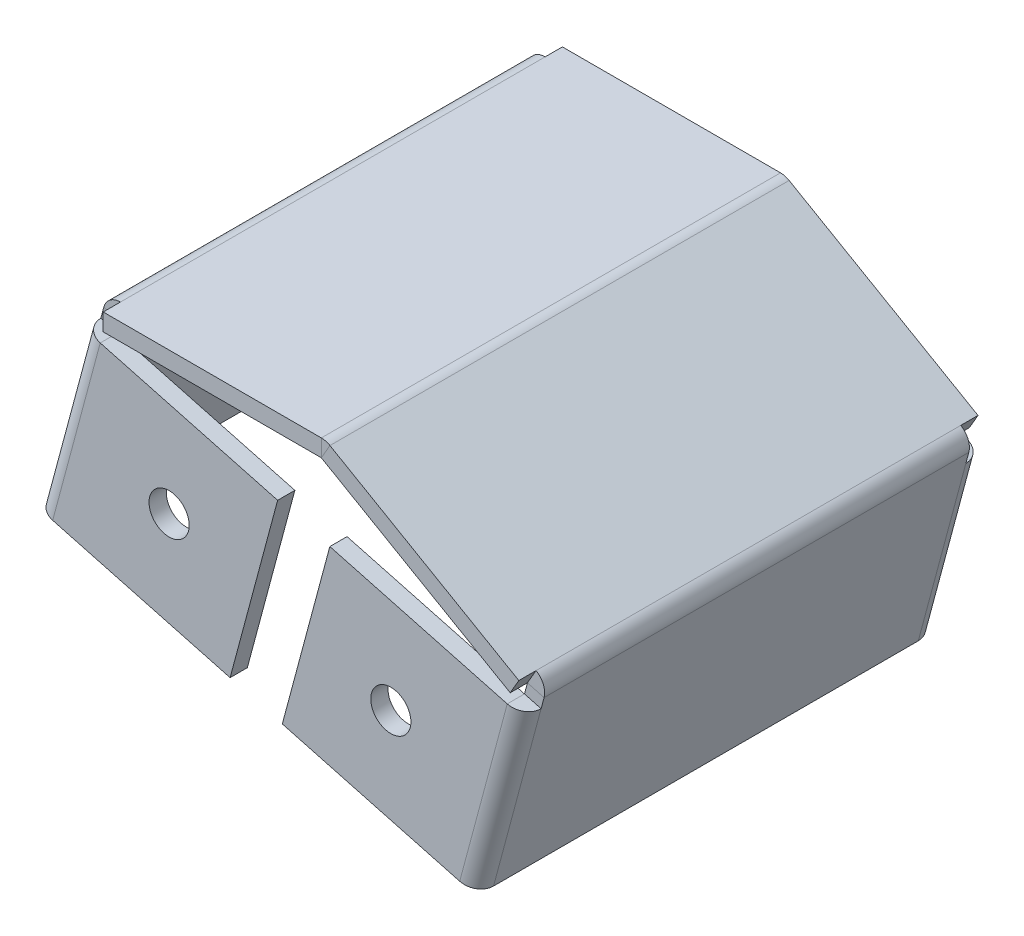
ISO-10303-21;
HEADER;
FILE_DESCRIPTION(('STEP AP214'),'2;1');
FILE_NAME('part.step','',(''),(''),'','','');
FILE_SCHEMA(('AUTOMOTIVE_DESIGN { 1 0 10303 214 1 1 1 1 }'));
ENDSEC;
DATA;
#1=APPLICATION_CONTEXT('core data for automotive mechanical design processes');
#2=APPLICATION_PROTOCOL_DEFINITION('international standard','automotive_design',2000,#1);
#3=PRODUCT_CONTEXT('',#1,'mechanical');
#4=PRODUCT('Part','Part','',(#3));
#5=PRODUCT_RELATED_PRODUCT_CATEGORY('part','',(#4));
#6=PRODUCT_DEFINITION_FORMATION('','',#4);
#7=PRODUCT_DEFINITION_CONTEXT('part definition',#1,'design');
#8=PRODUCT_DEFINITION('design','',#6,#7);
#9=PRODUCT_DEFINITION_SHAPE('','',#8);
#10=(LENGTH_UNIT() NAMED_UNIT(*) SI_UNIT(.MILLI.,.METRE.));
#11=(NAMED_UNIT(*) PLANE_ANGLE_UNIT() SI_UNIT($,.RADIAN.));
#12=(NAMED_UNIT(*) SI_UNIT($,.STERADIAN.) SOLID_ANGLE_UNIT());
#13=UNCERTAINTY_MEASURE_WITH_UNIT(LENGTH_MEASURE(1.E-05),#10,'distance_accuracy_value','');
#14=(GEOMETRIC_REPRESENTATION_CONTEXT(3) GLOBAL_UNCERTAINTY_ASSIGNED_CONTEXT((#13)) GLOBAL_UNIT_ASSIGNED_CONTEXT((#10,
#11,#12)) REPRESENTATION_CONTEXT('',''));
#15=CARTESIAN_POINT('',(0.,0.,0.));
#16=DIRECTION('',(0.,0.,1.));
#17=DIRECTION('',(1.,0.,0.));
#18=AXIS2_PLACEMENT_3D('',#15,#16,#17);
#19=CARTESIAN_POINT('',(0.,1.5,-69.));
#20=DIRECTION('',(0.,-1.,0.));
#21=DIRECTION('',(0.,0.,-1.));
#22=AXIS2_PLACEMENT_3D('',#19,#20,#21);
#23=PLANE('',#22);
#24=DIRECTION('',(0.,0.,1.));
#25=VECTOR('',#24,1.);
#26=CARTESIAN_POINT('',(17.,1.5,-53.));
#27=LINE('',#26,#25);
#28=CARTESIAN_POINT('',(17.,1.5,-54.5));
#29=VERTEX_POINT('',#28);
#30=CARTESIAN_POINT('',(17.,1.5,-53.));
#31=VERTEX_POINT('',#30);
#32=EDGE_CURVE('E547',#29,#31,#27,.T.);
#33=ORIENTED_EDGE('',*,*,#32,.T.);
#34=DIRECTION('',(0.,0.,1.));
#35=VECTOR('',#34,1.);
#36=CARTESIAN_POINT('',(17.,1.5,-69.));
#37=LINE('',#36,#35);
#38=CARTESIAN_POINT('',(17.,1.5,-16.));
#39=VERTEX_POINT('',#38);
#40=EDGE_CURVE('E614',#31,#39,#37,.T.);
#41=ORIENTED_EDGE('',*,*,#40,.T.);
#42=DIRECTION('',(0.,0.,1.));
#43=VECTOR('',#42,1.);
#44=CARTESIAN_POINT('',(17.,1.5,-14.5));
#45=LINE('',#44,#43);
#46=CARTESIAN_POINT('',(17.,1.5,-14.5));
#47=VERTEX_POINT('',#46);
#48=EDGE_CURVE('E545',#39,#47,#45,.T.);
#49=ORIENTED_EDGE('',*,*,#48,.T.);
#50=DIRECTION('',(1.,0.,0.));
#51=VECTOR('',#50,1.);
#52=CARTESIAN_POINT('',(17.,1.5,-14.5));
#53=LINE('',#52,#51);
#54=CARTESIAN_POINT('',(36.,1.5,-14.5));
#55=VERTEX_POINT('',#54);
#56=EDGE_CURVE('E543',#47,#55,#53,.T.);
#57=ORIENTED_EDGE('',*,*,#56,.T.);
#58=DIRECTION('',(0.,0.,1.));
#59=VECTOR('',#58,1.);
#60=CARTESIAN_POINT('',(36.,1.5,-69.));
#61=LINE('',#60,#59);
#62=CARTESIAN_POINT('',(36.,1.5,-54.5));
#63=VERTEX_POINT('',#62);
#64=EDGE_CURVE('E527',#63,#55,#61,.T.);
#65=ORIENTED_EDGE('',*,*,#64,.F.);
#66=DIRECTION('',(-1.,0.,0.));
#67=VECTOR('',#66,1.);
#68=CARTESIAN_POINT('',(17.,1.5,-54.5));
#69=LINE('',#68,#67);
#70=EDGE_CURVE('E550',#63,#29,#69,.T.);
#71=ORIENTED_EDGE('',*,*,#70,.T.);
#72=EDGE_LOOP('',(#33,#41,#49,#57,#65,#71));
#73=FACE_BOUND('',#72,.T.);
#74=ADVANCED_FACE('F61',(#73),#23,.F.);
#75=CARTESIAN_POINT('',(4.82312521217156,18.0001317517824,-69.));
#76=DIRECTION('',(-0.500000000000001,-0.866025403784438,0.));
#77=DIRECTION('',(0.,0.,-1.));
#78=AXIS2_PLACEMENT_3D('',#75,#76,#77);
#79=PLANE('',#78);
#80=DIRECTION('',(0.,0.,-1.));
#81=VECTOR('',#80,1.);
#82=CARTESIAN_POINT('',(52.4545224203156,-9.49986824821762,-54.5));
#83=LINE('',#82,#81);
#84=CARTESIAN_POINT('',(52.4545224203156,-9.49986824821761,-53.));
#85=VERTEX_POINT('',#84);
#86=CARTESIAN_POINT('',(52.4545224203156,-9.49986824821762,-54.5));
#87=VERTEX_POINT('',#86);
#88=EDGE_CURVE('E578',#85,#87,#83,.T.);
#89=ORIENTED_EDGE('',*,*,#88,.F.);
#90=DIRECTION('',(0.,0.,1.));
#91=VECTOR('',#90,1.);
#92=CARTESIAN_POINT('',(52.4545224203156,-9.49986824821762,-69.));
#93=LINE('',#92,#91);
#94=CARTESIAN_POINT('',(52.4545224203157,-9.49986824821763,-16.));
#95=VERTEX_POINT('',#94);
#96=EDGE_CURVE('E608',#85,#95,#93,.T.);
#97=ORIENTED_EDGE('',*,*,#96,.T.);
#98=DIRECTION('',(0.,0.,-1.));
#99=VECTOR('',#98,1.);
#100=CARTESIAN_POINT('',(52.4545224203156,-9.49986824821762,-16.));
#101=LINE('',#100,#99);
#102=CARTESIAN_POINT('',(52.4545224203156,-9.49986824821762,-14.5));
#103=VERTEX_POINT('',#102);
#104=EDGE_CURVE('E575',#103,#95,#101,.T.);
#105=ORIENTED_EDGE('',*,*,#104,.F.);
#106=DIRECTION('',(0.866025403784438,-0.500000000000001,0.));
#107=VECTOR('',#106,1.);
#108=CARTESIAN_POINT('',(19.545557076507,9.50013175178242,-14.5));
#109=LINE('',#108,#107);
#110=CARTESIAN_POINT('',(36.0005,-0.000133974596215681,-14.5));
#111=VERTEX_POINT('',#110);
#112=EDGE_CURVE('E534',#111,#103,#109,.T.);
#113=ORIENTED_EDGE('',*,*,#112,.F.);
#114=DIRECTION('',(0.,0.,1.));
#115=VECTOR('',#114,1.);
#116=CARTESIAN_POINT('',(36.0005,-0.000133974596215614,-69.));
#117=LINE('',#116,#115);
#118=CARTESIAN_POINT('',(36.0005,-0.000133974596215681,-54.5));
#119=VERTEX_POINT('',#118);
#120=EDGE_CURVE('E593',#119,#111,#117,.T.);
#121=ORIENTED_EDGE('',*,*,#120,.F.);
#122=DIRECTION('',(-0.866025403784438,0.500000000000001,0.));
#123=VECTOR('',#122,1.);
#124=CARTESIAN_POINT('',(19.545557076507,9.50013175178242,-54.5));
#125=LINE('',#124,#123);
#126=EDGE_CURVE('E580',#87,#119,#125,.T.);
#127=ORIENTED_EDGE('',*,*,#126,.F.);
#128=EDGE_LOOP('',(#89,#97,#105,#113,#121,#127));
#129=FACE_BOUND('',#128,.T.);
#130=ADVANCED_FACE('F663',(#129),#79,.T.);
#131=CARTESIAN_POINT('',(0.,0.,-69.));
#132=DIRECTION('',(0.,-1.,0.));
#133=DIRECTION('',(0.,0.,-1.));
#134=AXIS2_PLACEMENT_3D('',#131,#132,#133);
#135=PLANE('',#134);
#136=DIRECTION('',(0.,0.,1.));
#137=VECTOR('',#136,1.);
#138=CARTESIAN_POINT('',(17.,0.,-69.));
#139=LINE('',#138,#137);
#140=CARTESIAN_POINT('',(17.,0.,-53.));
#141=VERTEX_POINT('',#140);
#142=CARTESIAN_POINT('',(17.,0.,-16.));
#143=VERTEX_POINT('',#142);
#144=EDGE_CURVE('E69',#141,#143,#139,.T.);
#145=ORIENTED_EDGE('',*,*,#144,.F.);
#146=DIRECTION('',(0.,0.,1.));
#147=VECTOR('',#146,1.);
#148=CARTESIAN_POINT('',(17.,0.,-53.));
#149=LINE('',#148,#147);
#150=CARTESIAN_POINT('',(17.,0.,-54.5));
#151=VERTEX_POINT('',#150);
#152=EDGE_CURVE('E555',#151,#141,#149,.T.);
#153=ORIENTED_EDGE('',*,*,#152,.F.);
#154=DIRECTION('',(-1.,0.,0.));
#155=VECTOR('',#154,1.);
#156=CARTESIAN_POINT('',(17.,0.,-54.5));
#157=LINE('',#156,#155);
#158=CARTESIAN_POINT('',(36.,0.,-54.5));
#159=VERTEX_POINT('',#158);
#160=EDGE_CURVE('E541',#159,#151,#157,.T.);
#161=ORIENTED_EDGE('',*,*,#160,.F.);
#162=DIRECTION('',(0.,0.,1.));
#163=VECTOR('',#162,1.);
#164=CARTESIAN_POINT('',(36.,0.,-69.));
#165=LINE('',#164,#163);
#166=CARTESIAN_POINT('',(36.,0.,-14.5));
#167=VERTEX_POINT('',#166);
#168=EDGE_CURVE('E538',#159,#167,#165,.T.);
#169=ORIENTED_EDGE('',*,*,#168,.T.);
#170=DIRECTION('',(1.,0.,0.));
#171=VECTOR('',#170,1.);
#172=CARTESIAN_POINT('',(17.,0.,-14.5));
#173=LINE('',#172,#171);
#174=CARTESIAN_POINT('',(17.,0.,-14.5));
#175=VERTEX_POINT('',#174);
#176=EDGE_CURVE('E532',#175,#167,#173,.T.);
#177=ORIENTED_EDGE('',*,*,#176,.F.);
#178=DIRECTION('',(0.,0.,1.));
#179=VECTOR('',#178,1.);
#180=CARTESIAN_POINT('',(17.,0.,-14.5));
#181=LINE('',#180,#179);
#182=EDGE_CURVE('E558',#143,#175,#181,.T.);
#183=ORIENTED_EDGE('',*,*,#182,.F.);
#184=EDGE_LOOP('',(#145,#153,#161,#169,#177,#183));
#185=FACE_BOUND('',#184,.T.);
#186=ADVANCED_FACE('F63',(#185),#135,.T.);
#187=CARTESIAN_POINT('',(5.57312521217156,19.2991698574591,-69.));
#188=DIRECTION('',(-0.500000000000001,-0.866025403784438,0.));
#189=DIRECTION('',(0.,0.,-1.));
#190=AXIS2_PLACEMENT_3D('',#187,#188,#189);
#191=PLANE('',#190);
#192=DIRECTION('',(0.,0.,1.));
#193=VECTOR('',#192,1.);
#194=CARTESIAN_POINT('',(53.2045224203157,-8.20083014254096,-69.));
#195=LINE('',#194,#193);
#196=CARTESIAN_POINT('',(53.2045224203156,-8.20083014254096,-53.));
#197=VERTEX_POINT('',#196);
#198=CARTESIAN_POINT('',(53.2045224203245,-8.20083014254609,-16.));
#199=VERTEX_POINT('',#198);
#200=EDGE_CURVE('E598',#197,#199,#195,.T.);
#201=ORIENTED_EDGE('',*,*,#200,.F.);
#202=DIRECTION('',(0.,0.,-1.));
#203=VECTOR('',#202,1.);
#204=CARTESIAN_POINT('',(53.2045224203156,-8.20083014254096,-54.5));
#205=LINE('',#204,#203);
#206=CARTESIAN_POINT('',(53.2045224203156,-8.20083014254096,-54.5));
#207=VERTEX_POINT('',#206);
#208=EDGE_CURVE('E571',#197,#207,#205,.T.);
#209=ORIENTED_EDGE('',*,*,#208,.T.);
#210=DIRECTION('',(-0.866025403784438,0.500000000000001,0.));
#211=VECTOR('',#210,1.);
#212=CARTESIAN_POINT('',(20.295557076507,10.7991698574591,-54.5));
#213=LINE('',#212,#211);
#214=CARTESIAN_POINT('',(36.7505000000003,1.29890413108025,-54.5));
#215=VERTEX_POINT('',#214);
#216=EDGE_CURVE('E574',#207,#215,#213,.T.);
#217=ORIENTED_EDGE('',*,*,#216,.T.);
#218=DIRECTION('',(0.,0.,1.));
#219=VECTOR('',#218,1.);
#220=CARTESIAN_POINT('',(36.7505,1.29890413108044,-69.));
#221=LINE('',#220,#219);
#222=CARTESIAN_POINT('',(36.7505,1.29890413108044,-14.5));
#223=VERTEX_POINT('',#222);
#224=EDGE_CURVE('E587',#215,#223,#221,.T.);
#225=ORIENTED_EDGE('',*,*,#224,.T.);
#226=DIRECTION('',(0.866025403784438,-0.500000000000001,0.));
#227=VECTOR('',#226,1.);
#228=CARTESIAN_POINT('',(20.295557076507,10.7991698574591,-14.5));
#229=LINE('',#228,#227);
#230=CARTESIAN_POINT('',(53.2045224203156,-8.20083014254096,-14.5));
#231=VERTEX_POINT('',#230);
#232=EDGE_CURVE('E572',#223,#231,#229,.T.);
#233=ORIENTED_EDGE('',*,*,#232,.T.);
#234=DIRECTION('',(0.,0.,-1.));
#235=VECTOR('',#234,1.);
#236=CARTESIAN_POINT('',(53.2045224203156,-8.20083014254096,-16.));
#237=LINE('',#236,#235);
#238=EDGE_CURVE('E568',#231,#199,#237,.T.);
#239=ORIENTED_EDGE('',*,*,#238,.T.);
#240=EDGE_LOOP('',(#201,#209,#217,#225,#233,#239));
#241=FACE_BOUND('',#240,.T.);
#242=ADVANCED_FACE('F671',(#241),#191,.F.);
#243=CARTESIAN_POINT('',(20.295557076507,10.7991698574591,-14.5));
#244=DIRECTION('',(0.,0.,-1.));
#245=DIRECTION('',(-0.866025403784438,0.500000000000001,0.));
#246=AXIS2_PLACEMENT_3D('',#243,#244,#245);
#247=PLANE('',#246);
#248=ORIENTED_EDGE('',*,*,#232,.F.);
#249=DIRECTION('',(-0.500000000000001,-0.866025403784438,0.));
#250=VECTOR('',#249,1.);
#251=CARTESIAN_POINT('',(36.7505,1.29890413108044,-14.5));
#252=LINE('',#251,#250);
#253=EDGE_CURVE('E595',#223,#111,#252,.T.);
#254=ORIENTED_EDGE('',*,*,#253,.T.);
#255=ORIENTED_EDGE('',*,*,#112,.T.);
#256=DIRECTION('',(-0.500000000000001,-0.866025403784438,0.));
#257=VECTOR('',#256,1.);
#258=CARTESIAN_POINT('',(53.2045224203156,-8.20083014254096,-14.5));
#259=LINE('',#258,#257);
#260=EDGE_CURVE('E584',#231,#103,#259,.T.);
#261=ORIENTED_EDGE('',*,*,#260,.F.);
#262=EDGE_LOOP('',(#248,#254,#255,#261));
#263=FACE_BOUND('',#262,.T.);
#264=ADVANCED_FACE('F668',(#263),#247,.F.);
#265=CARTESIAN_POINT('',(20.295557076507,10.7991698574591,-54.5));
#266=DIRECTION('',(0.,0.,1.));
#267=DIRECTION('',(0.866025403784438,-0.500000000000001,0.));
#268=AXIS2_PLACEMENT_3D('',#265,#266,#267);
#269=PLANE('',#268);
#270=ORIENTED_EDGE('',*,*,#126,.T.);
#271=DIRECTION('',(0.500000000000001,0.866025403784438,0.));
#272=VECTOR('',#271,1.);
#273=CARTESIAN_POINT('',(36.7505,1.29890413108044,-54.5));
#274=LINE('',#273,#272);
#275=EDGE_CURVE('E590',#119,#215,#274,.T.);
#276=ORIENTED_EDGE('',*,*,#275,.T.);
#277=ORIENTED_EDGE('',*,*,#216,.F.);
#278=DIRECTION('',(-0.500000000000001,-0.866025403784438,0.));
#279=VECTOR('',#278,1.);
#280=CARTESIAN_POINT('',(53.2045224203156,-8.20083014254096,-54.5));
#281=LINE('',#280,#279);
#282=EDGE_CURVE('E581',#207,#87,#281,.T.);
#283=ORIENTED_EDGE('',*,*,#282,.T.);
#284=EDGE_LOOP('',(#270,#276,#277,#283));
#285=FACE_BOUND('',#284,.T.);
#286=ADVANCED_FACE('F679',(#285),#269,.F.);
#287=CARTESIAN_POINT('',(53.2045224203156,-8.20083014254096,-16.));
#288=DIRECTION('',(-0.866025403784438,0.500000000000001,0.));
#289=DIRECTION('',(0.,0.,1.));
#290=AXIS2_PLACEMENT_3D('',#287,#288,#289);
#291=PLANE('',#290);
#292=ORIENTED_EDGE('',*,*,#104,.T.);
#293=DIRECTION('',(-0.500000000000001,-0.866025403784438,0.));
#294=VECTOR('',#293,1.);
#295=CARTESIAN_POINT('',(53.2045224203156,-8.20083014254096,-16.));
#296=LINE('',#295,#294);
#297=EDGE_CURVE('E606',#199,#95,#296,.T.);
#298=ORIENTED_EDGE('',*,*,#297,.F.);
#299=ORIENTED_EDGE('',*,*,#238,.F.);
#300=ORIENTED_EDGE('',*,*,#260,.T.);
#301=EDGE_LOOP('',(#292,#298,#299,#300));
#302=FACE_BOUND('',#301,.T.);
#303=ADVANCED_FACE('F692',(#302),#291,.F.);
#304=CARTESIAN_POINT('',(53.2045224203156,-8.20083014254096,-54.5));
#305=DIRECTION('',(-0.866025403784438,0.500000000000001,0.));
#306=DIRECTION('',(0.,0.,1.));
#307=AXIS2_PLACEMENT_3D('',#304,#305,#306);
#308=PLANE('',#307);
#309=ORIENTED_EDGE('',*,*,#88,.T.);
#310=ORIENTED_EDGE('',*,*,#282,.F.);
#311=ORIENTED_EDGE('',*,*,#208,.F.);
#312=DIRECTION('',(-0.500000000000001,-0.866025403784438,0.));
#313=VECTOR('',#312,1.);
#314=CARTESIAN_POINT('',(53.2045224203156,-8.20083014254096,-53.));
#315=LINE('',#314,#313);
#316=EDGE_CURVE('E611',#197,#85,#315,.T.);
#317=ORIENTED_EDGE('',*,*,#316,.T.);
#318=EDGE_LOOP('',(#309,#310,#311,#317));
#319=FACE_BOUND('',#318,.T.);
#320=ADVANCED_FACE('F683',(#319),#308,.F.);
#321=CARTESIAN_POINT('',(17.,1.5,-14.5));
#322=DIRECTION('',(1.,0.,0.));
#323=DIRECTION('',(0.,0.,-1.));
#324=AXIS2_PLACEMENT_3D('',#321,#322,#323);
#325=PLANE('',#324);
#326=ORIENTED_EDGE('',*,*,#182,.T.);
#327=DIRECTION('',(0.,-1.,0.));
#328=VECTOR('',#327,1.);
#329=CARTESIAN_POINT('',(17.,1.5,-14.5));
#330=LINE('',#329,#328);
#331=EDGE_CURVE('E535',#47,#175,#330,.T.);
#332=ORIENTED_EDGE('',*,*,#331,.F.);
#333=ORIENTED_EDGE('',*,*,#48,.F.);
#334=DIRECTION('',(0.,-1.,0.));
#335=VECTOR('',#334,1.);
#336=CARTESIAN_POINT('',(17.,1.5,-16.));
#337=LINE('',#336,#335);
#338=EDGE_CURVE('E12',#39,#143,#337,.T.);
#339=ORIENTED_EDGE('',*,*,#338,.T.);
#340=EDGE_LOOP('',(#326,#332,#333,#339));
#341=FACE_BOUND('',#340,.T.);
#342=ADVANCED_FACE('F635',(#341),#325,.F.);
#343=CARTESIAN_POINT('',(17.,1.5,-53.));
#344=DIRECTION('',(1.,0.,0.));
#345=DIRECTION('',(0.,0.,-1.));
#346=AXIS2_PLACEMENT_3D('',#343,#344,#345);
#347=PLANE('',#346);
#348=ORIENTED_EDGE('',*,*,#152,.T.);
#349=DIRECTION('',(0.,-1.,0.));
#350=VECTOR('',#349,1.);
#351=CARTESIAN_POINT('',(17.,1.5,-53.));
#352=LINE('',#351,#350);
#353=EDGE_CURVE('E617',#31,#141,#352,.T.);
#354=ORIENTED_EDGE('',*,*,#353,.F.);
#355=ORIENTED_EDGE('',*,*,#32,.F.);
#356=DIRECTION('',(0.,-1.,0.));
#357=VECTOR('',#356,1.);
#358=CARTESIAN_POINT('',(17.,1.5,-54.5));
#359=LINE('',#358,#357);
#360=EDGE_CURVE('E552',#29,#151,#359,.T.);
#361=ORIENTED_EDGE('',*,*,#360,.T.);
#362=EDGE_LOOP('',(#348,#354,#355,#361));
#363=FACE_BOUND('',#362,.T.);
#364=ADVANCED_FACE('F627',(#363),#347,.F.);
#365=CARTESIAN_POINT('',(17.,1.5,-54.5));
#366=DIRECTION('',(0.,0.,1.));
#367=DIRECTION('',(1.,0.,0.));
#368=AXIS2_PLACEMENT_3D('',#365,#366,#367);
#369=PLANE('',#368);
#370=DIRECTION('',(0.,1.,0.));
#371=VECTOR('',#370,1.);
#372=CARTESIAN_POINT('',(36.,1.5,-54.5));
#373=LINE('',#372,#371);
#374=EDGE_CURVE('E560',#159,#63,#373,.T.);
#375=ORIENTED_EDGE('',*,*,#374,.F.);
#376=ORIENTED_EDGE('',*,*,#160,.T.);
#377=ORIENTED_EDGE('',*,*,#360,.F.);
#378=ORIENTED_EDGE('',*,*,#70,.F.);
#379=EDGE_LOOP('',(#375,#376,#377,#378));
#380=FACE_BOUND('',#379,.T.);
#381=ADVANCED_FACE('F645',(#380),#369,.F.);
#382=CARTESIAN_POINT('',(17.,1.5,-14.5));
#383=DIRECTION('',(0.,0.,-1.));
#384=DIRECTION('',(-1.,0.,0.));
#385=AXIS2_PLACEMENT_3D('',#382,#383,#384);
#386=PLANE('',#385);
#387=DIRECTION('',(0.,-1.,0.));
#388=VECTOR('',#387,1.);
#389=CARTESIAN_POINT('',(36.,1.5,-14.5));
#390=LINE('',#389,#388);
#391=EDGE_CURVE('E563',#55,#167,#390,.T.);
#392=ORIENTED_EDGE('',*,*,#391,.F.);
#393=ORIENTED_EDGE('',*,*,#56,.F.);
#394=ORIENTED_EDGE('',*,*,#331,.T.);
#395=ORIENTED_EDGE('',*,*,#176,.T.);
#396=EDGE_LOOP('',(#392,#393,#394,#395));
#397=FACE_BOUND('',#396,.T.);
#398=ADVANCED_FACE('F788',(#397),#386,.F.);
#399=CARTESIAN_POINT('',(36.,-0.000999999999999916,-54.5));
#400=DIRECTION('',(0.,0.,-1.));
#401=DIRECTION('',(-1.,0.,0.));
#402=AXIS2_PLACEMENT_3D('',#399,#400,#401);
#403=PLANE('',#402);
#404=ORIENTED_EDGE('',*,*,#275,.F.);
#405=CARTESIAN_POINT('',(36.,-0.000999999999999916,-54.5));
#406=DIRECTION('',(0.,0.,-1.));
#407=DIRECTION('',(-1.,0.,0.));
#408=AXIS2_PLACEMENT_3D('',#405,#406,#407);
#409=CIRCLE('',#408,0.000999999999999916);
#410=EDGE_CURVE('E517',#119,#159,#409,.F.);
#411=ORIENTED_EDGE('',*,*,#410,.T.);
#412=ORIENTED_EDGE('',*,*,#374,.T.);
#413=CARTESIAN_POINT('',(36.,-0.000999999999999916,-54.5));
#414=DIRECTION('',(0.,0.,1.));
#415=DIRECTION('',(1.,0.,0.));
#416=AXIS2_PLACEMENT_3D('',#413,#414,#415);
#417=CIRCLE('',#416,1.501);
#418=EDGE_CURVE('E521',#215,#63,#417,.T.);
#419=ORIENTED_EDGE('',*,*,#418,.F.);
#420=EDGE_LOOP('',(#404,#411,#412,#419));
#421=FACE_BOUND('',#420,.T.);
#422=ADVANCED_FACE('F677',(#421),#403,.T.);
#423=CARTESIAN_POINT('',(36.,-0.000999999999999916,-14.5));
#424=DIRECTION('',(0.,0.,1.));
#425=DIRECTION('',(1.,0.,0.));
#426=AXIS2_PLACEMENT_3D('',#423,#424,#425);
#427=PLANE('',#426);
#428=CARTESIAN_POINT('',(36.,-0.000999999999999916,-14.5));
#429=DIRECTION('',(0.,0.,-1.));
#430=DIRECTION('',(-1.,0.,0.));
#431=AXIS2_PLACEMENT_3D('',#428,#429,#430);
#432=CIRCLE('',#431,0.000999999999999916);
#433=EDGE_CURVE('E525',#167,#111,#432,.T.);
#434=ORIENTED_EDGE('',*,*,#433,.T.);
#435=ORIENTED_EDGE('',*,*,#253,.F.);
#436=CARTESIAN_POINT('',(36.,-0.000999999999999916,-14.5));
#437=DIRECTION('',(0.,0.,-1.));
#438=DIRECTION('',(-1.,0.,0.));
#439=AXIS2_PLACEMENT_3D('',#436,#437,#438);
#440=CIRCLE('',#439,1.501);
#441=EDGE_CURVE('E524',#55,#223,#440,.T.);
#442=ORIENTED_EDGE('',*,*,#441,.F.);
#443=ORIENTED_EDGE('',*,*,#391,.T.);
#444=EDGE_LOOP('',(#434,#435,#442,#443));
#445=FACE_BOUND('',#444,.T.);
#446=ADVANCED_FACE('F653',(#445),#427,.T.);
#447=CARTESIAN_POINT('',(36.,-0.000999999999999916,5.52811512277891));
#448=DIRECTION('',(0.,0.,-1.));
#449=DIRECTION('',(-1.,0.,0.));
#450=AXIS2_PLACEMENT_3D('',#447,#448,#449);
#451=CYLINDRICAL_SURFACE('',#450,1.501);
#452=ORIENTED_EDGE('',*,*,#64,.T.);
#453=ORIENTED_EDGE('',*,*,#441,.T.);
#454=ORIENTED_EDGE('',*,*,#224,.F.);
#455=ORIENTED_EDGE('',*,*,#418,.T.);
#456=EDGE_LOOP('',(#452,#453,#454,#455));
#457=FACE_BOUND('',#456,.T.);
#458=ADVANCED_FACE('F675',(#457),#451,.T.);
#459=CARTESIAN_POINT('',(36.,-0.000999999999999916,5.52811512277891));
#460=DIRECTION('',(0.,0.,-1.));
#461=DIRECTION('',(-1.,0.,0.));
#462=AXIS2_PLACEMENT_3D('',#459,#460,#461);
#463=CYLINDRICAL_SURFACE('',#462,0.000999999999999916);
#464=ORIENTED_EDGE('',*,*,#168,.F.);
#465=ORIENTED_EDGE('',*,*,#410,.F.);
#466=ORIENTED_EDGE('',*,*,#120,.T.);
#467=ORIENTED_EDGE('',*,*,#433,.F.);
#468=EDGE_LOOP('',(#464,#465,#466,#467));
#469=FACE_BOUND('',#468,.T.);
#470=ADVANCED_FACE('F658',(#469),#463,.F.);
#471=CARTESIAN_POINT('',(52.4540224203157,-9.50073427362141,-53.));
#472=DIRECTION('',(0.,0.,-1.));
#473=DIRECTION('',(-1.,0.,0.));
#474=AXIS2_PLACEMENT_3D('',#471,#472,#473);
#475=PLANE('',#474);
#476=DIRECTION('',(0.965925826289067,-0.258819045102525,0.));
#477=VECTOR('',#476,1.);
#478=CARTESIAN_POINT('',(53.9038770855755,-9.88922166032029,-53.));
#479=LINE('',#478,#477);
#480=CARTESIAN_POINT('',(52.4549883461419,-9.50099309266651,-53.));
#481=VERTEX_POINT('',#480);
#482=CARTESIAN_POINT('',(53.9038770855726,-9.88922166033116,-53.));
#483=VERTEX_POINT('',#482);
#484=EDGE_CURVE('E388',#481,#483,#479,.T.);
#485=ORIENTED_EDGE('',*,*,#484,.F.);
#486=CARTESIAN_POINT('',(52.4540224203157,-9.50073427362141,-53.));
#487=DIRECTION('',(0.,0.,-1.));
#488=DIRECTION('',(-1.,0.,0.));
#489=AXIS2_PLACEMENT_3D('',#486,#487,#488);
#490=CIRCLE('',#489,0.000999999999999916);
#491=EDGE_CURVE('E83',#481,#85,#490,.F.);
#492=ORIENTED_EDGE('',*,*,#491,.T.);
#493=ORIENTED_EDGE('',*,*,#316,.F.);
#494=CARTESIAN_POINT('',(52.4540224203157,-9.50073427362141,-53.));
#495=DIRECTION('',(0.,0.,1.));
#496=DIRECTION('',(1.,0.,0.));
#497=AXIS2_PLACEMENT_3D('',#494,#495,#496);
#498=CIRCLE('',#497,1.501);
#499=EDGE_CURVE('E510',#483,#197,#498,.T.);
#500=ORIENTED_EDGE('',*,*,#499,.F.);
#501=EDGE_LOOP('',(#485,#492,#493,#500));
#502=FACE_BOUND('',#501,.T.);
#503=ADVANCED_FACE('F760',(#502),#475,.T.);
#504=CARTESIAN_POINT('',(52.4540224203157,-9.50073427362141,-16.));
#505=DIRECTION('',(0.,0.,1.));
#506=DIRECTION('',(1.,0.,0.));
#507=AXIS2_PLACEMENT_3D('',#504,#505,#506);
#508=PLANE('',#507);
#509=CARTESIAN_POINT('',(52.4540224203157,-9.50073427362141,-16.));
#510=DIRECTION('',(0.,0.,-1.));
#511=DIRECTION('',(-1.,0.,0.));
#512=AXIS2_PLACEMENT_3D('',#509,#510,#511);
#513=CIRCLE('',#512,0.000999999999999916);
#514=CARTESIAN_POINT('',(52.4549883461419,-9.50099309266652,-16.));
#515=VERTEX_POINT('',#514);
#516=EDGE_CURVE('E514',#95,#515,#513,.T.);
#517=ORIENTED_EDGE('',*,*,#516,.T.);
#518=DIRECTION('',(-0.965925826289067,0.258819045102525,0.));
#519=VECTOR('',#518,1.);
#520=CARTESIAN_POINT('',(53.9038770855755,-9.8892216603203,-16.));
#521=LINE('',#520,#519);
#522=CARTESIAN_POINT('',(53.9038770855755,-9.8892216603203,-16.));
#523=VERTEX_POINT('',#522);
#524=EDGE_CURVE('E396',#523,#515,#521,.T.);
#525=ORIENTED_EDGE('',*,*,#524,.F.);
#526=CARTESIAN_POINT('',(52.4540224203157,-9.50073427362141,-16.));
#527=DIRECTION('',(0.,0.,-1.));
#528=DIRECTION('',(-1.,0.,0.));
#529=AXIS2_PLACEMENT_3D('',#526,#527,#528);
#530=CIRCLE('',#529,1.501);
#531=EDGE_CURVE('E513',#199,#523,#530,.T.);
#532=ORIENTED_EDGE('',*,*,#531,.F.);
#533=ORIENTED_EDGE('',*,*,#297,.T.);
#534=EDGE_LOOP('',(#517,#525,#532,#533));
#535=FACE_BOUND('',#534,.T.);
#536=ADVANCED_FACE('F699',(#535),#508,.T.);
#537=CARTESIAN_POINT('',(52.4540224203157,-9.50073427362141,2.53043955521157));
#538=DIRECTION('',(0.,0.,-1.));
#539=DIRECTION('',(-1.,0.,0.));
#540=AXIS2_PLACEMENT_3D('',#537,#538,#539);
#541=CYLINDRICAL_SURFACE('',#540,1.501);
#542=ORIENTED_EDGE('',*,*,#200,.T.);
#543=ORIENTED_EDGE('',*,*,#531,.T.);
#544=DIRECTION('',(0.,0.,1.));
#545=VECTOR('',#544,1.);
#546=CARTESIAN_POINT('',(53.9038770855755,-9.88922166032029,-69.));
#547=LINE('',#546,#545);
#548=EDGE_CURVE('E407',#483,#523,#547,.T.);
#549=ORIENTED_EDGE('',*,*,#548,.F.);
#550=ORIENTED_EDGE('',*,*,#499,.T.);
#551=EDGE_LOOP('',(#542,#543,#549,#550));
#552=FACE_BOUND('',#551,.T.);
#553=ADVANCED_FACE('F696',(#552),#541,.T.);
#554=CARTESIAN_POINT('',(52.4540224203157,-9.50073427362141,2.53043955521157));
#555=DIRECTION('',(0.,0.,-1.));
#556=DIRECTION('',(-1.,0.,0.));
#557=AXIS2_PLACEMENT_3D('',#554,#555,#556);
#558=CYLINDRICAL_SURFACE('',#557,0.000999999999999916);
#559=ORIENTED_EDGE('',*,*,#96,.F.);
#560=ORIENTED_EDGE('',*,*,#491,.F.);
#561=DIRECTION('',(0.,0.,1.));
#562=VECTOR('',#561,1.);
#563=CARTESIAN_POINT('',(52.4549883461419,-9.50099309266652,-69.));
#564=LINE('',#563,#562);
#565=EDGE_CURVE('E380',#481,#515,#564,.T.);
#566=ORIENTED_EDGE('',*,*,#565,.T.);
#567=ORIENTED_EDGE('',*,*,#516,.F.);
#568=EDGE_LOOP('',(#559,#560,#566,#567));
#569=FACE_BOUND('',#568,.T.);
#570=ADVANCED_FACE('F686',(#569),#558,.F.);
#571=CARTESIAN_POINT('',(36.7417227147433,-6.3245369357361,-14.5000000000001));
#572=DIRECTION('',(0.965925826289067,-0.258819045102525,0.));
#573=DIRECTION('',(0.258819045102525,0.965925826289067,0.));
#574=AXIS2_PLACEMENT_3D('',#571,#572,#573);
#575=PLANE('',#574);
#576=DIRECTION('',(-0.258819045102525,-0.965925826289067,0.));
#577=VECTOR('',#576,1.);
#578=CARTESIAN_POINT('',(36.7417227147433,-6.3245369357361,-16.0000000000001));
#579=LINE('',#578,#577);
#580=CARTESIAN_POINT('',(36.7417227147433,-6.3245369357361,-16.0000000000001));
#581=VERTEX_POINT('',#580);
#582=CARTESIAN_POINT('',(32.6006179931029,-21.7793501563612,-16.0000000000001));
#583=VERTEX_POINT('',#582);
#584=EDGE_CURVE('E506',#581,#583,#579,.T.);
#585=ORIENTED_EDGE('',*,*,#584,.T.);
#586=DIRECTION('',(0.,0.,-1.));
#587=VECTOR('',#586,1.);
#588=CARTESIAN_POINT('',(32.6006179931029,-21.7793501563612,-14.5000000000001));
#589=LINE('',#588,#587);
#590=CARTESIAN_POINT('',(32.6006179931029,-21.7793501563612,-14.5000000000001));
#591=VERTEX_POINT('',#590);
#592=EDGE_CURVE('E500',#591,#583,#589,.T.);
#593=ORIENTED_EDGE('',*,*,#592,.F.);
#594=DIRECTION('',(-0.258819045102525,-0.965925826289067,0.));
#595=VECTOR('',#594,1.);
#596=CARTESIAN_POINT('',(36.7417227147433,-6.3245369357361,-14.5000000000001));
#597=LINE('',#596,#595);
#598=CARTESIAN_POINT('',(36.7417227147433,-6.3245369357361,-14.5000000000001));
#599=VERTEX_POINT('',#598);
#600=EDGE_CURVE('E449',#599,#591,#597,.T.);
#601=ORIENTED_EDGE('',*,*,#600,.F.);
#602=DIRECTION('',(0.,0.,-1.));
#603=VECTOR('',#602,1.);
#604=CARTESIAN_POINT('',(36.7417227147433,-6.3245369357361,-14.5000000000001));
#605=LINE('',#604,#603);
#606=EDGE_CURVE('E503',#599,#581,#605,.T.);
#607=ORIENTED_EDGE('',*,*,#606,.T.);
#608=EDGE_LOOP('',(#585,#593,#601,#607));
#609=FACE_BOUND('',#608,.T.);
#610=ADVANCED_FACE('F870',(#609),#575,.F.);
#611=CARTESIAN_POINT('',(32.6006179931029,-21.7793501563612,-14.5000000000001));
#612=DIRECTION('',(0.258819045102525,0.965925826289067,0.));
#613=DIRECTION('',(-0.965925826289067,0.258819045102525,0.));
#614=AXIS2_PLACEMENT_3D('',#611,#612,#613);
#615=PLANE('',#614);
#616=DIRECTION('',(0.,0.,-1.));
#617=VECTOR('',#616,1.);
#618=CARTESIAN_POINT('',(48.0554084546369,-25.9204487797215,-14.5));
#619=LINE('',#618,#617);
#620=CARTESIAN_POINT('',(48.0554084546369,-25.9204487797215,-14.5));
#621=VERTEX_POINT('',#620);
#622=CARTESIAN_POINT('',(48.0554084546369,-25.9204487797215,-16.));
#623=VERTEX_POINT('',#622);
#624=EDGE_CURVE('E453',#621,#623,#619,.T.);
#625=ORIENTED_EDGE('',*,*,#624,.F.);
#626=DIRECTION('',(0.965925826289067,-0.258819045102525,0.));
#627=VECTOR('',#626,1.);
#628=CARTESIAN_POINT('',(32.6006179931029,-21.7793501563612,-14.5000000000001));
#629=LINE('',#628,#627);
#630=EDGE_CURVE('E446',#591,#621,#629,.T.);
#631=ORIENTED_EDGE('',*,*,#630,.F.);
#632=ORIENTED_EDGE('',*,*,#592,.T.);
#633=DIRECTION('',(0.965925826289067,-0.258819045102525,0.));
#634=VECTOR('',#633,1.);
#635=CARTESIAN_POINT('',(32.6006179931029,-21.7793501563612,-16.0000000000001));
#636=LINE('',#635,#634);
#637=EDGE_CURVE('E497',#583,#623,#636,.T.);
#638=ORIENTED_EDGE('',*,*,#637,.T.);
#639=EDGE_LOOP('',(#625,#631,#632,#638));
#640=FACE_BOUND('',#639,.T.);
#641=ADVANCED_FACE('F726',(#640),#615,.F.);
#642=CARTESIAN_POINT('',(42.055673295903,-16.0306151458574,-14.5));
#643=DIRECTION('',(0.,0.,-1.));
#644=DIRECTION('',(0.965925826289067,-0.258819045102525,0.));
#645=AXIS2_PLACEMENT_3D('',#642,#643,#644);
#646=CYLINDRICAL_SURFACE('',#645,1.75);
#647=CARTESIAN_POINT('',(42.055673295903,-16.0306151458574,-14.5));
#648=DIRECTION('',(0.,0.,1.));
#649=DIRECTION('',(-0.965925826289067,0.258819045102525,0.));
#650=AXIS2_PLACEMENT_3D('',#647,#648,#649);
#651=CIRCLE('',#650,1.75);
#652=CARTESIAN_POINT('',(40.3653030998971,-15.577681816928,-14.5));
#653=VERTEX_POINT('',#652);
#654=EDGE_CURVE('E494',#653,#653,#651,.T.);
#655=ORIENTED_EDGE('',*,*,#654,.T.);
#656=EDGE_LOOP('',(#655));
#657=FACE_BOUND('',#656,.T.);
#658=CARTESIAN_POINT('',(42.055673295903,-16.0306151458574,-16.));
#659=DIRECTION('',(0.,0.,1.));
#660=DIRECTION('',(-0.965925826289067,0.258819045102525,0.));
#661=AXIS2_PLACEMENT_3D('',#658,#659,#660);
#662=CIRCLE('',#661,1.75);
#663=CARTESIAN_POINT('',(40.3653030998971,-15.577681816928,-16.));
#664=VERTEX_POINT('',#663);
#665=EDGE_CURVE('E443',#664,#664,#662,.T.);
#666=ORIENTED_EDGE('',*,*,#665,.F.);
#667=EDGE_LOOP('',(#666));
#668=FACE_BOUND('',#667,.T.);
#669=ADVANCED_FACE('F890',(#657,#668),#646,.F.);
#670=CARTESIAN_POINT('',(42.055673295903,-16.0306151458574,-54.5));
#671=DIRECTION('',(0.,0.,1.));
#672=DIRECTION('',(-0.965925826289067,0.258819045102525,0.));
#673=AXIS2_PLACEMENT_3D('',#670,#671,#672);
#674=CYLINDRICAL_SURFACE('',#673,1.75);
#675=CARTESIAN_POINT('',(42.055673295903,-16.0306151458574,-54.5));
#676=DIRECTION('',(0.,0.,-1.));
#677=DIRECTION('',(0.965925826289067,-0.258819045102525,0.));
#678=AXIS2_PLACEMENT_3D('',#675,#676,#677);
#679=CIRCLE('',#678,1.75);
#680=CARTESIAN_POINT('',(43.7460434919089,-16.4835484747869,-54.5));
#681=VERTEX_POINT('',#680);
#682=EDGE_CURVE('E491',#681,#681,#679,.T.);
#683=ORIENTED_EDGE('',*,*,#682,.T.);
#684=EDGE_LOOP('',(#683));
#685=FACE_BOUND('',#684,.T.);
#686=CARTESIAN_POINT('',(42.055673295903,-16.0306151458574,-53.));
#687=DIRECTION('',(0.,0.,-1.));
#688=DIRECTION('',(0.965925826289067,-0.258819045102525,0.));
#689=AXIS2_PLACEMENT_3D('',#686,#687,#688);
#690=CIRCLE('',#689,1.75);
#691=CARTESIAN_POINT('',(43.7460434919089,-16.4835484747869,-53.));
#692=VERTEX_POINT('',#691);
#693=EDGE_CURVE('E437',#692,#692,#690,.T.);
#694=ORIENTED_EDGE('',*,*,#693,.F.);
#695=EDGE_LOOP('',(#694));
#696=FACE_BOUND('',#695,.T.);
#697=ADVANCED_FACE('F900',(#685,#696),#674,.F.);
#698=CARTESIAN_POINT('',(99.2495000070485,-39.6378642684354,-54.5000000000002));
#699=DIRECTION('',(0.258819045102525,0.965925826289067,0.));
#700=DIRECTION('',(0.965925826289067,-0.258819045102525,0.));
#701=AXIS2_PLACEMENT_3D('',#698,#699,#700);
#702=PLANE('',#701);
#703=DIRECTION('',(-0.965925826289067,0.258819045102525,0.));
#704=VECTOR('',#703,1.);
#705=CARTESIAN_POINT('',(99.2495000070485,-39.6378642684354,-54.5000000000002));
#706=LINE('',#705,#704);
#707=CARTESIAN_POINT('',(48.0554084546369,-25.9204487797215,-54.5));
#708=VERTEX_POINT('',#707);
#709=CARTESIAN_POINT('',(32.6006179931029,-21.7793501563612,-54.5));
#710=VERTEX_POINT('',#709);
#711=EDGE_CURVE('E462',#708,#710,#706,.T.);
#712=ORIENTED_EDGE('',*,*,#711,.F.);
#713=DIRECTION('',(0.,0.,1.));
#714=VECTOR('',#713,1.);
#715=CARTESIAN_POINT('',(48.0554084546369,-25.9204487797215,-54.5));
#716=LINE('',#715,#714);
#717=CARTESIAN_POINT('',(48.0554084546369,-25.9204487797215,-53.));
#718=VERTEX_POINT('',#717);
#719=EDGE_CURVE('E488',#708,#718,#716,.T.);
#720=ORIENTED_EDGE('',*,*,#719,.T.);
#721=DIRECTION('',(-0.965925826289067,0.258819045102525,0.));
#722=VECTOR('',#721,1.);
#723=CARTESIAN_POINT('',(99.2495000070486,-39.6378642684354,-53.0000000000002));
#724=LINE('',#723,#722);
#725=CARTESIAN_POINT('',(32.6006179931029,-21.7793501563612,-53.));
#726=VERTEX_POINT('',#725);
#727=EDGE_CURVE('E486',#718,#726,#724,.T.);
#728=ORIENTED_EDGE('',*,*,#727,.T.);
#729=DIRECTION('',(0.,0.,1.));
#730=VECTOR('',#729,1.);
#731=CARTESIAN_POINT('',(32.6006179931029,-21.7793501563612,-54.5));
#732=LINE('',#731,#730);
#733=EDGE_CURVE('E481',#710,#726,#732,.T.);
#734=ORIENTED_EDGE('',*,*,#733,.F.);
#735=EDGE_LOOP('',(#712,#720,#728,#734));
#736=FACE_BOUND('',#735,.T.);
#737=ADVANCED_FACE('F746',(#736),#702,.F.);
#738=CARTESIAN_POINT('',(36.7417227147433,-6.3245369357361,-54.5));
#739=DIRECTION('',(0.965925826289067,-0.258819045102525,0.));
#740=DIRECTION('',(-0.258819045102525,-0.965925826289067,0.));
#741=AXIS2_PLACEMENT_3D('',#738,#739,#740);
#742=PLANE('',#741);
#743=DIRECTION('',(0.258819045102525,0.965925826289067,0.));
#744=VECTOR('',#743,1.);
#745=CARTESIAN_POINT('',(36.7417227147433,-6.3245369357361,-52.9999999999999));
#746=LINE('',#745,#744);
#747=CARTESIAN_POINT('',(36.7417227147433,-6.3245369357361,-52.9999999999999));
#748=VERTEX_POINT('',#747);
#749=EDGE_CURVE('E484',#726,#748,#746,.T.);
#750=ORIENTED_EDGE('',*,*,#749,.T.);
#751=DIRECTION('',(0.,0.,1.));
#752=VECTOR('',#751,1.);
#753=CARTESIAN_POINT('',(36.7417227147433,-6.3245369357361,-54.5));
#754=LINE('',#753,#752);
#755=CARTESIAN_POINT('',(36.7417227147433,-6.3245369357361,-54.5));
#756=VERTEX_POINT('',#755);
#757=EDGE_CURVE('E472',#756,#748,#754,.T.);
#758=ORIENTED_EDGE('',*,*,#757,.F.);
#759=DIRECTION('',(0.258819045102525,0.965925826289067,0.));
#760=VECTOR('',#759,1.);
#761=CARTESIAN_POINT('',(36.7417227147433,-6.3245369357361,-54.5));
#762=LINE('',#761,#760);
#763=EDGE_CURVE('E460',#710,#756,#762,.T.);
#764=ORIENTED_EDGE('',*,*,#763,.F.);
#765=ORIENTED_EDGE('',*,*,#733,.T.);
#766=EDGE_LOOP('',(#750,#758,#764,#765));
#767=FACE_BOUND('',#766,.T.);
#768=ADVANCED_FACE('F921',(#767),#742,.F.);
#769=CARTESIAN_POINT('',(52.1965359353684,-10.4656416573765,-54.5));
#770=DIRECTION('',(-0.258819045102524,-0.965925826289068,0.));
#771=DIRECTION('',(-0.965925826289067,0.258819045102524,0.));
#772=AXIS2_PLACEMENT_3D('',#769,#770,#771);
#773=PLANE('',#772);
#774=DIRECTION('',(0.965925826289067,-0.258819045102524,0.));
#775=VECTOR('',#774,1.);
#776=CARTESIAN_POINT('',(52.1965359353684,-10.4656416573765,-53.));
#777=LINE('',#776,#775);
#778=CARTESIAN_POINT('',(52.1965131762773,-10.4656355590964,-53.));
#779=VERTEX_POINT('',#778);
#780=EDGE_CURVE('E478',#748,#779,#777,.T.);
#781=ORIENTED_EDGE('',*,*,#780,.T.);
#782=DIRECTION('',(0.,0.,-1.));
#783=VECTOR('',#782,1.);
#784=CARTESIAN_POINT('',(52.1965131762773,-10.4656355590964,-54.5));
#785=LINE('',#784,#783);
#786=CARTESIAN_POINT('',(52.1965131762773,-10.4656355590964,-54.5));
#787=VERTEX_POINT('',#786);
#788=EDGE_CURVE('E475',#779,#787,#785,.T.);
#789=ORIENTED_EDGE('',*,*,#788,.T.);
#790=DIRECTION('',(0.965925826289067,-0.258819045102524,0.));
#791=VECTOR('',#790,1.);
#792=CARTESIAN_POINT('',(52.1965359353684,-10.4656416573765,-54.5));
#793=LINE('',#792,#791);
#794=EDGE_CURVE('E467',#756,#787,#793,.T.);
#795=ORIENTED_EDGE('',*,*,#794,.F.);
#796=ORIENTED_EDGE('',*,*,#757,.T.);
#797=EDGE_LOOP('',(#781,#789,#795,#796));
#798=FACE_BOUND('',#797,.T.);
#799=ADVANCED_FACE('F931',(#798),#773,.F.);
#800=CARTESIAN_POINT('',(36.7417227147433,-6.3245369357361,-14.5000000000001));
#801=DIRECTION('',(-0.258819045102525,-0.965925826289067,0.));
#802=DIRECTION('',(0.965925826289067,-0.258819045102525,0.));
#803=AXIS2_PLACEMENT_3D('',#800,#801,#802);
#804=PLANE('',#803);
#805=DIRECTION('',(0.,0.,1.));
#806=VECTOR('',#805,1.);
#807=CARTESIAN_POINT('',(52.1965131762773,-10.4656355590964,-14.5));
#808=LINE('',#807,#806);
#809=CARTESIAN_POINT('',(52.1965131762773,-10.4656355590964,-16.));
#810=VERTEX_POINT('',#809);
#811=CARTESIAN_POINT('',(52.1965131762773,-10.4656355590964,-14.5));
#812=VERTEX_POINT('',#811);
#813=EDGE_CURVE('E431',#810,#812,#808,.T.);
#814=ORIENTED_EDGE('',*,*,#813,.F.);
#815=DIRECTION('',(-0.965925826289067,0.258819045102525,0.));
#816=VECTOR('',#815,1.);
#817=CARTESIAN_POINT('',(36.7417227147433,-6.3245369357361,-16.0000000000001));
#818=LINE('',#817,#816);
#819=EDGE_CURVE('E470',#810,#581,#818,.T.);
#820=ORIENTED_EDGE('',*,*,#819,.T.);
#821=ORIENTED_EDGE('',*,*,#606,.F.);
#822=DIRECTION('',(-0.965925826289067,0.258819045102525,0.));
#823=VECTOR('',#822,1.);
#824=CARTESIAN_POINT('',(36.7417227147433,-6.3245369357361,-14.5000000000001));
#825=LINE('',#824,#823);
#826=EDGE_CURVE('E451',#812,#599,#825,.T.);
#827=ORIENTED_EDGE('',*,*,#826,.F.);
#828=EDGE_LOOP('',(#814,#820,#821,#827));
#829=FACE_BOUND('',#828,.T.);
#830=ADVANCED_FACE('F943',(#829),#804,.F.);
#831=CARTESIAN_POINT('',(51.2355892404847,47.7673093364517,-54.5));
#832=DIRECTION('',(0.,0.,1.));
#833=DIRECTION('',(-0.965925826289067,0.258819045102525,0.));
#834=AXIS2_PLACEMENT_3D('',#831,#832,#833);
#835=PLANE('',#834);
#836=ORIENTED_EDGE('',*,*,#682,.F.);
#837=EDGE_LOOP('',(#836));
#838=FACE_BOUND('',#837,.T.);
#839=ORIENTED_EDGE('',*,*,#794,.T.);
#840=DIRECTION('',(-0.258819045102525,-0.965925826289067,0.));
#841=VECTOR('',#840,1.);
#842=CARTESIAN_POINT('',(66.6903797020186,43.6262107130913,-54.5));
#843=LINE('',#842,#841);
#844=EDGE_CURVE('E464',#787,#708,#843,.T.);
#845=ORIENTED_EDGE('',*,*,#844,.T.);
#846=ORIENTED_EDGE('',*,*,#711,.T.);
#847=ORIENTED_EDGE('',*,*,#763,.T.);
#848=EDGE_LOOP('',(#839,#845,#846,#847));
#849=FACE_BOUND('',#848,.T.);
#850=ADVANCED_FACE('F751',(#838,#849),#835,.F.);
#851=CARTESIAN_POINT('',(48.0554084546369,-25.9204487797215,-54.5));
#852=DIRECTION('',(0.258819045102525,0.965925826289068,0.));
#853=DIRECTION('',(-0.965925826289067,0.258819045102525,0.));
#854=AXIS2_PLACEMENT_3D('',#851,#852,#853);
#855=PLANE('',#854);
#856=DIRECTION('',(-0.965925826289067,0.258819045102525,0.));
#857=VECTOR('',#856,1.);
#858=CARTESIAN_POINT('',(49.5042971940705,-26.3086773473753,-53.));
#859=LINE('',#858,#857);
#860=CARTESIAN_POINT('',(49.5042971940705,-26.3086773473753,-53.));
#861=VERTEX_POINT('',#860);
#862=EDGE_CURVE('E457',#861,#718,#859,.T.);
#863=ORIENTED_EDGE('',*,*,#862,.T.);
#864=ORIENTED_EDGE('',*,*,#719,.F.);
#865=CARTESIAN_POINT('',(48.0554084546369,-25.9204487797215,-53.));
#866=DIRECTION('',(-0.258819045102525,-0.965925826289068,0.));
#867=DIRECTION('',(0.965925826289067,-0.258819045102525,0.));
#868=AXIS2_PLACEMENT_3D('',#865,#866,#867);
#869=CIRCLE('',#868,1.5);
#870=EDGE_CURVE('E455',#708,#861,#869,.T.);
#871=ORIENTED_EDGE('',*,*,#870,.T.);
#872=EDGE_LOOP('',(#863,#864,#871));
#873=FACE_BOUND('',#872,.T.);
#874=ADVANCED_FACE('F748',(#873),#855,.F.);
#875=CARTESIAN_POINT('',(48.0554084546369,-25.9204487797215,-14.5));
#876=DIRECTION('',(-0.258819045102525,-0.965925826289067,0.));
#877=DIRECTION('',(0.965925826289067,-0.258819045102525,0.));
#878=AXIS2_PLACEMENT_3D('',#875,#876,#877);
#879=PLANE('',#878);
#880=ORIENTED_EDGE('',*,*,#624,.T.);
#881=DIRECTION('',(-0.965925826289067,0.258819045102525,0.));
#882=VECTOR('',#881,1.);
#883=CARTESIAN_POINT('',(49.5042971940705,-26.3086773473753,-16.));
#884=LINE('',#883,#882);
#885=CARTESIAN_POINT('',(49.5042971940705,-26.3086773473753,-16.));
#886=VERTEX_POINT('',#885);
#887=EDGE_CURVE('E420',#886,#623,#884,.T.);
#888=ORIENTED_EDGE('',*,*,#887,.F.);
#889=CARTESIAN_POINT('',(48.0554084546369,-25.9204487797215,-16.));
#890=DIRECTION('',(0.258819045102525,0.965925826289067,0.));
#891=DIRECTION('',(-0.965925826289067,0.258819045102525,0.));
#892=AXIS2_PLACEMENT_3D('',#889,#890,#891);
#893=CIRCLE('',#892,1.5);
#894=EDGE_CURVE('E412',#621,#886,#893,.T.);
#895=ORIENTED_EDGE('',*,*,#894,.F.);
#896=EDGE_LOOP('',(#880,#888,#895));
#897=FACE_BOUND('',#896,.T.);
#898=ADVANCED_FACE('F718',(#897),#879,.T.);
#899=CARTESIAN_POINT('',(117.88447125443,29.9087952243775,-14.4999999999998));
#900=DIRECTION('',(0.,0.,-1.));
#901=DIRECTION('',(0.965925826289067,-0.258819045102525,0.));
#902=AXIS2_PLACEMENT_3D('',#899,#900,#901);
#903=PLANE('',#902);
#904=DIRECTION('',(-0.258819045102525,-0.965925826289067,0.));
#905=VECTOR('',#904,1.);
#906=CARTESIAN_POINT('',(66.6903797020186,43.6262107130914,-14.5));
#907=LINE('',#906,#905);
#908=EDGE_CURVE('E414',#812,#621,#907,.T.);
#909=ORIENTED_EDGE('',*,*,#908,.F.);
#910=ORIENTED_EDGE('',*,*,#826,.T.);
#911=ORIENTED_EDGE('',*,*,#600,.T.);
#912=ORIENTED_EDGE('',*,*,#630,.T.);
#913=EDGE_LOOP('',(#909,#910,#911,#912));
#914=FACE_BOUND('',#913,.T.);
#915=ORIENTED_EDGE('',*,*,#654,.F.);
#916=EDGE_LOOP('',(#915));
#917=FACE_BOUND('',#916,.T.);
#918=ADVANCED_FACE('F981',(#914,#917),#903,.F.);
#919=CARTESIAN_POINT('',(52.1965131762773,-10.4656355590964,-54.5));
#920=DIRECTION('',(0.258819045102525,0.965925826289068,0.));
#921=DIRECTION('',(-0.965925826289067,0.258819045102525,0.));
#922=AXIS2_PLACEMENT_3D('',#919,#920,#921);
#923=PLANE('',#922);
#924=ORIENTED_EDGE('',*,*,#788,.F.);
#925=DIRECTION('',(-0.965925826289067,0.258819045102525,0.));
#926=VECTOR('',#925,1.);
#927=CARTESIAN_POINT('',(53.6454019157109,-10.8538641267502,-53.));
#928=LINE('',#927,#926);
#929=CARTESIAN_POINT('',(53.6454019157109,-10.8538641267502,-53.));
#930=VERTEX_POINT('',#929);
#931=EDGE_CURVE('E385',#930,#779,#928,.T.);
#932=ORIENTED_EDGE('',*,*,#931,.F.);
#933=CARTESIAN_POINT('',(52.1965131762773,-10.4656355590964,-53.));
#934=DIRECTION('',(-0.258819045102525,-0.965925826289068,0.));
#935=DIRECTION('',(0.965925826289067,-0.258819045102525,0.));
#936=AXIS2_PLACEMENT_3D('',#933,#934,#935);
#937=CIRCLE('',#936,1.5);
#938=EDGE_CURVE('E426',#787,#930,#937,.T.);
#939=ORIENTED_EDGE('',*,*,#938,.F.);
#940=EDGE_LOOP('',(#924,#932,#939));
#941=FACE_BOUND('',#940,.T.);
#942=ADVANCED_FACE('F991',(#941),#923,.T.);
#943=CARTESIAN_POINT('',(117.88447125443,29.9087952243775,-15.9999999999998));
#944=DIRECTION('',(0.,0.,-1.));
#945=DIRECTION('',(0.965925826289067,-0.258819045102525,0.));
#946=AXIS2_PLACEMENT_3D('',#943,#944,#945);
#947=PLANE('',#946);
#948=ORIENTED_EDGE('',*,*,#665,.T.);
#949=EDGE_LOOP('',(#948));
#950=FACE_BOUND('',#949,.T.);
#951=ORIENTED_EDGE('',*,*,#819,.F.);
#952=DIRECTION('',(-0.258819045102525,-0.965925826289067,0.));
#953=VECTOR('',#952,1.);
#954=CARTESIAN_POINT('',(66.6903797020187,43.6262107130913,-16.));
#955=LINE('',#954,#953);
#956=EDGE_CURVE('E440',#810,#623,#955,.T.);
#957=ORIENTED_EDGE('',*,*,#956,.T.);
#958=ORIENTED_EDGE('',*,*,#637,.F.);
#959=ORIENTED_EDGE('',*,*,#584,.F.);
#960=EDGE_LOOP('',(#951,#957,#958,#959));
#961=FACE_BOUND('',#960,.T.);
#962=ADVANCED_FACE('F731',(#950,#961),#947,.T.);
#963=CARTESIAN_POINT('',(51.2355892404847,47.7673093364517,-52.9999999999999));
#964=DIRECTION('',(0.,0.,1.));
#965=DIRECTION('',(-0.965925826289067,0.258819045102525,0.));
#966=AXIS2_PLACEMENT_3D('',#963,#964,#965);
#967=PLANE('',#966);
#968=DIRECTION('',(-0.258819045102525,-0.965925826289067,0.));
#969=VECTOR('',#968,1.);
#970=CARTESIAN_POINT('',(66.6903797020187,43.6262107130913,-53.));
#971=LINE('',#970,#969);
#972=EDGE_CURVE('E392',#779,#718,#971,.T.);
#973=ORIENTED_EDGE('',*,*,#972,.F.);
#974=ORIENTED_EDGE('',*,*,#780,.F.);
#975=ORIENTED_EDGE('',*,*,#749,.F.);
#976=ORIENTED_EDGE('',*,*,#727,.F.);
#977=EDGE_LOOP('',(#973,#974,#975,#976));
#978=FACE_BOUND('',#977,.T.);
#979=ORIENTED_EDGE('',*,*,#693,.T.);
#980=EDGE_LOOP('',(#979));
#981=FACE_BOUND('',#980,.T.);
#982=ADVANCED_FACE('F739',(#978,#981),#967,.T.);
#983=CARTESIAN_POINT('',(52.1965131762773,-10.4656355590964,-14.5));
#984=DIRECTION('',(-0.258819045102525,-0.965925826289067,0.));
#985=DIRECTION('',(0.965925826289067,-0.258819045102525,0.));
#986=AXIS2_PLACEMENT_3D('',#983,#984,#985);
#987=PLANE('',#986);
#988=DIRECTION('',(-0.965925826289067,0.258819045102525,0.));
#989=VECTOR('',#988,1.);
#990=CARTESIAN_POINT('',(53.6454019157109,-10.8538641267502,-16.));
#991=LINE('',#990,#989);
#992=CARTESIAN_POINT('',(53.6454019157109,-10.8538641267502,-16.));
#993=VERTEX_POINT('',#992);
#994=EDGE_CURVE('E434',#993,#810,#991,.T.);
#995=ORIENTED_EDGE('',*,*,#994,.T.);
#996=ORIENTED_EDGE('',*,*,#813,.T.);
#997=CARTESIAN_POINT('',(52.1965131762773,-10.4656355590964,-16.));
#998=DIRECTION('',(0.258819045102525,0.965925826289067,0.));
#999=DIRECTION('',(-0.965925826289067,0.258819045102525,0.));
#1000=AXIS2_PLACEMENT_3D('',#997,#998,#999);
#1001=CIRCLE('',#1000,1.5);
#1002=EDGE_CURVE('E428',#812,#993,#1001,.T.);
#1003=ORIENTED_EDGE('',*,*,#1002,.T.);
#1004=EDGE_LOOP('',(#995,#996,#1003));
#1005=FACE_BOUND('',#1004,.T.);
#1006=ADVANCED_FACE('F710',(#1005),#987,.F.);
#1007=CARTESIAN_POINT('',(48.0554084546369,-25.9204487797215,-53.));
#1008=DIRECTION('',(-0.258819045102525,-0.965925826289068,0.));
#1009=DIRECTION('',(0.965925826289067,-0.258819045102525,0.));
#1010=AXIS2_PLACEMENT_3D('',#1007,#1008,#1009);
#1011=CYLINDRICAL_SURFACE('',#1010,1.5);
#1012=ORIENTED_EDGE('',*,*,#870,.F.);
#1013=ORIENTED_EDGE('',*,*,#844,.F.);
#1014=ORIENTED_EDGE('',*,*,#938,.T.);
#1015=DIRECTION('',(-0.258819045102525,-0.965925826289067,0.));
#1016=VECTOR('',#1015,1.);
#1017=CARTESIAN_POINT('',(68.1392684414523,43.2379821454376,-53.));
#1018=LINE('',#1017,#1016);
#1019=EDGE_CURVE('E423',#930,#861,#1018,.T.);
#1020=ORIENTED_EDGE('',*,*,#1019,.T.);
#1021=EDGE_LOOP('',(#1012,#1013,#1014,#1020));
#1022=FACE_BOUND('',#1021,.T.);
#1023=ADVANCED_FACE('F754',(#1022),#1011,.T.);
#1024=CARTESIAN_POINT('',(49.5042971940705,-26.3086773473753,0.));
#1025=DIRECTION('',(0.258819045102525,0.965925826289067,0.));
#1026=DIRECTION('',(0.,0.,1.));
#1027=AXIS2_PLACEMENT_3D('',#1024,#1025,#1026);
#1028=PLANE('',#1027);
#1029=DIRECTION('',(0.,0.,-1.));
#1030=VECTOR('',#1029,1.);
#1031=CARTESIAN_POINT('',(49.5042971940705,-26.3086773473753,0.));
#1032=LINE('',#1031,#1030);
#1033=EDGE_CURVE('E399',#886,#861,#1032,.T.);
#1034=ORIENTED_EDGE('',*,*,#1033,.F.);
#1035=ORIENTED_EDGE('',*,*,#887,.T.);
#1036=DIRECTION('',(0.,0.,-1.));
#1037=VECTOR('',#1036,1.);
#1038=CARTESIAN_POINT('',(48.0554084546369,-25.9204487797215,0.));
#1039=LINE('',#1038,#1037);
#1040=EDGE_CURVE('E417',#623,#718,#1039,.T.);
#1041=ORIENTED_EDGE('',*,*,#1040,.T.);
#1042=ORIENTED_EDGE('',*,*,#862,.F.);
#1043=EDGE_LOOP('',(#1034,#1035,#1041,#1042));
#1044=FACE_BOUND('',#1043,.T.);
#1045=ADVANCED_FACE('F722',(#1044),#1028,.F.);
#1046=CARTESIAN_POINT('',(52.1965131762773,-10.4656355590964,-16.));
#1047=DIRECTION('',(0.258819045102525,0.965925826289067,0.));
#1048=DIRECTION('',(-0.965925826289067,0.258819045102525,0.));
#1049=AXIS2_PLACEMENT_3D('',#1046,#1047,#1048);
#1050=CYLINDRICAL_SURFACE('',#1049,1.5);
#1051=ORIENTED_EDGE('',*,*,#1002,.F.);
#1052=ORIENTED_EDGE('',*,*,#908,.T.);
#1053=ORIENTED_EDGE('',*,*,#894,.T.);
#1054=DIRECTION('',(-0.258819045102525,-0.965925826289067,0.));
#1055=VECTOR('',#1054,1.);
#1056=CARTESIAN_POINT('',(68.1392684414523,43.2379821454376,-16.));
#1057=LINE('',#1056,#1055);
#1058=EDGE_CURVE('E402',#993,#886,#1057,.T.);
#1059=ORIENTED_EDGE('',*,*,#1058,.F.);
#1060=EDGE_LOOP('',(#1051,#1052,#1053,#1059));
#1061=FACE_BOUND('',#1060,.T.);
#1062=ADVANCED_FACE('F715',(#1061),#1050,.T.);
#1063=CARTESIAN_POINT('',(68.1392684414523,43.2379821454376,-69.));
#1064=DIRECTION('',(-0.965925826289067,0.258819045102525,0.));
#1065=DIRECTION('',(0.,0.,-1.));
#1066=AXIS2_PLACEMENT_3D('',#1063,#1064,#1065);
#1067=PLANE('',#1066);
#1068=DIRECTION('',(0.258819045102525,0.965925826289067,0.));
#1069=VECTOR('',#1068,1.);
#1070=CARTESIAN_POINT('',(53.9042209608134,-9.88793830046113,-53.));
#1071=LINE('',#1070,#1069);
#1072=EDGE_CURVE('E409',#930,#483,#1071,.T.);
#1073=ORIENTED_EDGE('',*,*,#1072,.T.);
#1074=ORIENTED_EDGE('',*,*,#548,.T.);
#1075=DIRECTION('',(-0.258819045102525,-0.965925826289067,0.));
#1076=VECTOR('',#1075,1.);
#1077=CARTESIAN_POINT('',(53.6454019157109,-10.8538641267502,-16.));
#1078=LINE('',#1077,#1076);
#1079=EDGE_CURVE('E405',#523,#993,#1078,.T.);
#1080=ORIENTED_EDGE('',*,*,#1079,.T.);
#1081=ORIENTED_EDGE('',*,*,#1058,.T.);
#1082=ORIENTED_EDGE('',*,*,#1033,.T.);
#1083=ORIENTED_EDGE('',*,*,#1019,.F.);
#1084=EDGE_LOOP('',(#1073,#1074,#1080,#1081,#1082,#1083));
#1085=FACE_BOUND('',#1084,.T.);
#1086=ADVANCED_FACE('F706',(#1085),#1067,.F.);
#1087=CARTESIAN_POINT('',(53.6454019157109,-10.8538641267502,-16.));
#1088=DIRECTION('',(0.,0.,-1.));
#1089=DIRECTION('',(0.258819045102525,0.965925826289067,0.));
#1090=AXIS2_PLACEMENT_3D('',#1087,#1088,#1089);
#1091=PLANE('',#1090);
#1092=ORIENTED_EDGE('',*,*,#1079,.F.);
#1093=ORIENTED_EDGE('',*,*,#524,.T.);
#1094=DIRECTION('',(-0.258819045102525,-0.965925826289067,0.));
#1095=VECTOR('',#1094,1.);
#1096=CARTESIAN_POINT('',(52.1965131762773,-10.4656355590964,-16.));
#1097=LINE('',#1096,#1095);
#1098=EDGE_CURVE('E394',#515,#810,#1097,.T.);
#1099=ORIENTED_EDGE('',*,*,#1098,.T.);
#1100=ORIENTED_EDGE('',*,*,#994,.F.);
#1101=EDGE_LOOP('',(#1092,#1093,#1099,#1100));
#1102=FACE_BOUND('',#1101,.T.);
#1103=ADVANCED_FACE('F702',(#1102),#1091,.F.);
#1104=CARTESIAN_POINT('',(66.6903797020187,43.6262107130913,-69.));
#1105=DIRECTION('',(-0.965925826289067,0.258819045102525,0.));
#1106=DIRECTION('',(0.,0.,-1.));
#1107=AXIS2_PLACEMENT_3D('',#1104,#1105,#1106);
#1108=PLANE('',#1107);
#1109=ORIENTED_EDGE('',*,*,#565,.F.);
#1110=DIRECTION('',(0.258819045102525,0.965925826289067,0.));
#1111=VECTOR('',#1110,1.);
#1112=CARTESIAN_POINT('',(52.4553322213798,-9.49970973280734,-53.));
#1113=LINE('',#1112,#1111);
#1114=EDGE_CURVE('E390',#779,#481,#1113,.T.);
#1115=ORIENTED_EDGE('',*,*,#1114,.F.);
#1116=ORIENTED_EDGE('',*,*,#972,.T.);
#1117=ORIENTED_EDGE('',*,*,#1040,.F.);
#1118=ORIENTED_EDGE('',*,*,#956,.F.);
#1119=ORIENTED_EDGE('',*,*,#1098,.F.);
#1120=EDGE_LOOP('',(#1109,#1115,#1116,#1117,#1118,#1119));
#1121=FACE_BOUND('',#1120,.T.);
#1122=ADVANCED_FACE('F733',(#1121),#1108,.T.);
#1123=CARTESIAN_POINT('',(53.9042209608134,-9.88793830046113,-53.));
#1124=DIRECTION('',(0.,0.,1.));
#1125=DIRECTION('',(-0.258819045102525,-0.965925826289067,0.));
#1126=AXIS2_PLACEMENT_3D('',#1123,#1124,#1125);
#1127=PLANE('',#1126);
#1128=ORIENTED_EDGE('',*,*,#1114,.T.);
#1129=ORIENTED_EDGE('',*,*,#484,.T.);
#1130=ORIENTED_EDGE('',*,*,#1072,.F.);
#1131=ORIENTED_EDGE('',*,*,#931,.T.);
#1132=EDGE_LOOP('',(#1128,#1129,#1130,#1131));
#1133=FACE_BOUND('',#1132,.T.);
#1134=ADVANCED_FACE('F759',(#1133),#1127,.F.);
#1135=CARTESIAN_POINT('',(17.,-0.000999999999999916,-53.));
#1136=DIRECTION('',(0.,0.,-1.));
#1137=DIRECTION('',(-1.,0.,0.));
#1138=AXIS2_PLACEMENT_3D('',#1135,#1136,#1137);
#1139=PLANE('',#1138);
#1140=ORIENTED_EDGE('',*,*,#353,.T.);
#1141=CARTESIAN_POINT('',(17.,-0.000999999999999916,-53.));
#1142=DIRECTION('',(0.,0.,1.));
#1143=DIRECTION('',(1.,0.,0.));
#1144=AXIS2_PLACEMENT_3D('',#1141,#1142,#1143);
#1145=CIRCLE('',#1144,0.000999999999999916);
#1146=CARTESIAN_POINT('',(16.9990340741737,-0.000741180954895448,-53.));
#1147=VERTEX_POINT('',#1146);
#1148=EDGE_CURVE('E382',#141,#1147,#1145,.T.);
#1149=ORIENTED_EDGE('',*,*,#1148,.T.);
#1150=DIRECTION('',(-0.965925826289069,0.258819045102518,0.));
#1151=VECTOR('',#1150,1.);
#1152=CARTESIAN_POINT('',(15.5501453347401,0.38748738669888,-53.));
#1153=LINE('',#1152,#1151);
#1154=CARTESIAN_POINT('',(15.5501453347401,0.38748738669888,-53.));
#1155=VERTEX_POINT('',#1154);
#1156=EDGE_CURVE('E364',#1147,#1155,#1153,.T.);
#1157=ORIENTED_EDGE('',*,*,#1156,.T.);
#1158=CARTESIAN_POINT('',(17.,-0.000999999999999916,-53.));
#1159=DIRECTION('',(0.,0.,1.));
#1160=DIRECTION('',(1.,0.,0.));
#1161=AXIS2_PLACEMENT_3D('',#1158,#1159,#1160);
#1162=CIRCLE('',#1161,1.501);
#1163=EDGE_CURVE('E373',#31,#1155,#1162,.T.);
#1164=ORIENTED_EDGE('',*,*,#1163,.F.);
#1165=EDGE_LOOP('',(#1140,#1149,#1157,#1164));
#1166=FACE_BOUND('',#1165,.T.);
#1167=ADVANCED_FACE('F620',(#1166),#1139,.T.);
#1168=CARTESIAN_POINT('',(17.,-0.000999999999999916,-16.));
#1169=DIRECTION('',(0.,0.,1.));
#1170=DIRECTION('',(1.,0.,0.));
#1171=AXIS2_PLACEMENT_3D('',#1168,#1169,#1170);
#1172=PLANE('',#1171);
#1173=DIRECTION('',(0.965925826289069,-0.258819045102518,0.));
#1174=VECTOR('',#1173,1.);
#1175=CARTESIAN_POINT('',(15.5501453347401,0.38748738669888,-16.));
#1176=LINE('',#1175,#1174);
#1177=CARTESIAN_POINT('',(15.5501453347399,0.387487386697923,-16.));
#1178=VERTEX_POINT('',#1177);
#1179=CARTESIAN_POINT('',(16.9990340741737,-0.000741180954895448,-16.));
#1180=VERTEX_POINT('',#1179);
#1181=EDGE_CURVE('E367',#1178,#1180,#1176,.T.);
#1182=ORIENTED_EDGE('',*,*,#1181,.T.);
#1183=CARTESIAN_POINT('',(17.,-0.000999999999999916,-16.));
#1184=DIRECTION('',(0.,0.,1.));
#1185=DIRECTION('',(1.,0.,0.));
#1186=AXIS2_PLACEMENT_3D('',#1183,#1184,#1185);
#1187=CIRCLE('',#1186,0.000999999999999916);
#1188=EDGE_CURVE('E377',#1180,#143,#1187,.F.);
#1189=ORIENTED_EDGE('',*,*,#1188,.T.);
#1190=ORIENTED_EDGE('',*,*,#338,.F.);
#1191=CARTESIAN_POINT('',(17.,-0.000999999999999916,-16.));
#1192=DIRECTION('',(0.,0.,-1.));
#1193=DIRECTION('',(-1.,0.,0.));
#1194=AXIS2_PLACEMENT_3D('',#1191,#1192,#1193);
#1195=CIRCLE('',#1194,1.501);
#1196=EDGE_CURVE('E376',#1178,#39,#1195,.T.);
#1197=ORIENTED_EDGE('',*,*,#1196,.F.);
#1198=EDGE_LOOP('',(#1182,#1189,#1190,#1197));
#1199=FACE_BOUND('',#1198,.T.);
#1200=ADVANCED_FACE('F638',(#1199),#1172,.T.);
#1201=CARTESIAN_POINT('',(17.,-0.000999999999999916,-71.5303929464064));
#1202=DIRECTION('',(0.,0.,1.));
#1203=DIRECTION('',(1.,0.,0.));
#1204=AXIS2_PLACEMENT_3D('',#1201,#1202,#1203);
#1205=CYLINDRICAL_SURFACE('',#1204,1.501);
#1206=ORIENTED_EDGE('',*,*,#1196,.T.);
#1207=ORIENTED_EDGE('',*,*,#40,.F.);
#1208=ORIENTED_EDGE('',*,*,#1163,.T.);
#1209=DIRECTION('',(0.,0.,1.));
#1210=VECTOR('',#1209,1.);
#1211=CARTESIAN_POINT('',(15.5501453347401,0.38748738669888,-69.));
#1212=LINE('',#1211,#1210);
#1213=EDGE_CURVE('E370',#1155,#1178,#1212,.T.);
#1214=ORIENTED_EDGE('',*,*,#1213,.T.);
#1215=EDGE_LOOP('',(#1206,#1207,#1208,#1214));
#1216=FACE_BOUND('',#1215,.T.);
#1217=ADVANCED_FACE('F640',(#1216),#1205,.T.);
#1218=CARTESIAN_POINT('',(17.,-0.000999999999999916,-71.5303929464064));
#1219=DIRECTION('',(0.,0.,1.));
#1220=DIRECTION('',(1.,0.,0.));
#1221=AXIS2_PLACEMENT_3D('',#1218,#1219,#1220);
#1222=CYLINDRICAL_SURFACE('',#1221,0.000999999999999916);
#1223=ORIENTED_EDGE('',*,*,#1188,.F.);
#1224=DIRECTION('',(0.,0.,1.));
#1225=VECTOR('',#1224,1.);
#1226=CARTESIAN_POINT('',(16.9990340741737,-0.000741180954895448,-69.));
#1227=LINE('',#1226,#1225);
#1228=EDGE_CURVE('E310',#1147,#1180,#1227,.T.);
#1229=ORIENTED_EDGE('',*,*,#1228,.F.);
#1230=ORIENTED_EDGE('',*,*,#1148,.F.);
#1231=ORIENTED_EDGE('',*,*,#144,.T.);
#1232=EDGE_LOOP('',(#1223,#1229,#1230,#1231));
#1233=FACE_BOUND('',#1232,.T.);
#1234=ADVANCED_FACE('F625',(#1233),#1222,.F.);
#1235=CARTESIAN_POINT('',(28.0542446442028,-20.5612954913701,-54.5));
#1236=DIRECTION('',(-0.965925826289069,0.258819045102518,0.));
#1237=DIRECTION('',(0.258819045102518,0.965925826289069,0.));
#1238=AXIS2_PLACEMENT_3D('',#1235,#1236,#1237);
#1239=PLANE('',#1238);
#1240=DIRECTION('',(-0.258819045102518,-0.965925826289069,0.));
#1241=VECTOR('',#1240,1.);
#1242=CARTESIAN_POINT('',(28.0542446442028,-20.5612954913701,-53.));
#1243=LINE('',#1242,#1241);
#1244=CARTESIAN_POINT('',(32.1953493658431,-5.10648227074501,-53.));
#1245=VERTEX_POINT('',#1244);
#1246=CARTESIAN_POINT('',(28.0542446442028,-20.5612954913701,-53.));
#1247=VERTEX_POINT('',#1246);
#1248=EDGE_CURVE('E362',#1245,#1247,#1243,.T.);
#1249=ORIENTED_EDGE('',*,*,#1248,.T.);
#1250=DIRECTION('',(0.,0.,1.));
#1251=VECTOR('',#1250,1.);
#1252=CARTESIAN_POINT('',(28.0542446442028,-20.5612954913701,-54.5));
#1253=LINE('',#1252,#1251);
#1254=CARTESIAN_POINT('',(28.0542446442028,-20.5612954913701,-54.5));
#1255=VERTEX_POINT('',#1254);
#1256=EDGE_CURVE('E356',#1255,#1247,#1253,.T.);
#1257=ORIENTED_EDGE('',*,*,#1256,.F.);
#1258=DIRECTION('',(-0.258819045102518,-0.965925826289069,0.));
#1259=VECTOR('',#1258,1.);
#1260=CARTESIAN_POINT('',(28.0542446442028,-20.5612954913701,-54.5));
#1261=LINE('',#1260,#1259);
#1262=CARTESIAN_POINT('',(32.1953493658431,-5.10648227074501,-54.5));
#1263=VERTEX_POINT('',#1262);
#1264=EDGE_CURVE('E1449',#1263,#1255,#1261,.T.);
#1265=ORIENTED_EDGE('',*,*,#1264,.F.);
#1266=DIRECTION('',(0.,0.,1.));
#1267=VECTOR('',#1266,1.);
#1268=CARTESIAN_POINT('',(32.1953493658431,-5.10648227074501,-54.5));
#1269=LINE('',#1268,#1267);
#1270=EDGE_CURVE('E359',#1263,#1245,#1269,.T.);
#1271=ORIENTED_EDGE('',*,*,#1270,.T.);
#1272=EDGE_LOOP('',(#1249,#1257,#1265,#1271));
#1273=FACE_BOUND('',#1272,.T.);
#1274=ADVANCED_FACE('F1154',(#1273),#1239,.F.);
#1275=CARTESIAN_POINT('',(-38.594637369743,-2.70278137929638,-54.5000000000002));
#1276=DIRECTION('',(0.258819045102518,0.965925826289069,0.));
#1277=DIRECTION('',(0.965925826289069,-0.258819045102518,0.));
#1278=AXIS2_PLACEMENT_3D('',#1275,#1276,#1277);
#1279=PLANE('',#1278);
#1280=DIRECTION('',(0.,0.,1.));
#1281=VECTOR('',#1280,1.);
#1282=CARTESIAN_POINT('',(12.5994541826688,-16.4201968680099,-54.5));
#1283=LINE('',#1282,#1281);
#1284=CARTESIAN_POINT('',(12.5994541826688,-16.4201968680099,-54.5));
#1285=VERTEX_POINT('',#1284);
#1286=CARTESIAN_POINT('',(12.5994541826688,-16.4201968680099,-53.));
#1287=VERTEX_POINT('',#1286);
#1288=EDGE_CURVE('E1453',#1285,#1287,#1283,.T.);
#1289=ORIENTED_EDGE('',*,*,#1288,.F.);
#1290=DIRECTION('',(-0.965925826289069,0.258819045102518,0.));
#1291=VECTOR('',#1290,1.);
#1292=CARTESIAN_POINT('',(-38.594637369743,-2.70278137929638,-54.5000000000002));
#1293=LINE('',#1292,#1291);
#1294=EDGE_CURVE('E1446',#1255,#1285,#1293,.T.);
#1295=ORIENTED_EDGE('',*,*,#1294,.F.);
#1296=ORIENTED_EDGE('',*,*,#1256,.T.);
#1297=DIRECTION('',(-0.965925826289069,0.258819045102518,0.));
#1298=VECTOR('',#1297,1.);
#1299=CARTESIAN_POINT('',(-38.594637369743,-2.70278137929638,-53.0000000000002));
#1300=LINE('',#1299,#1298);
#1301=EDGE_CURVE('E354',#1247,#1287,#1300,.T.);
#1302=ORIENTED_EDGE('',*,*,#1301,.T.);
#1303=EDGE_LOOP('',(#1289,#1295,#1296,#1302));
#1304=FACE_BOUND('',#1303,.T.);
#1305=ADVANCED_FACE('F1164',(#1304),#1279,.F.);
#1306=CARTESIAN_POINT('',(22.740294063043,-10.8552172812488,-54.5));
#1307=DIRECTION('',(0.,0.,1.));
#1308=DIRECTION('',(0.965925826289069,-0.258819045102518,0.));
#1309=AXIS2_PLACEMENT_3D('',#1306,#1307,#1308);
#1310=CYLINDRICAL_SURFACE('',#1309,1.75);
#1311=CARTESIAN_POINT('',(22.740294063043,-10.8552172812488,-54.5));
#1312=DIRECTION('',(0.,0.,-1.));
#1313=DIRECTION('',(-0.965925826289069,0.258819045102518,0.));
#1314=AXIS2_PLACEMENT_3D('',#1311,#1312,#1313);
#1315=CIRCLE('',#1314,1.75);
#1316=CARTESIAN_POINT('',(21.0499238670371,-10.4022839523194,-54.5));
#1317=VERTEX_POINT('',#1316);
#1318=EDGE_CURVE('E348',#1317,#1317,#1315,.T.);
#1319=ORIENTED_EDGE('',*,*,#1318,.T.);
#1320=EDGE_LOOP('',(#1319));
#1321=FACE_BOUND('',#1320,.T.);
#1322=CARTESIAN_POINT('',(22.740294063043,-10.8552172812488,-53.));
#1323=DIRECTION('',(0.,0.,-1.));
#1324=DIRECTION('',(-0.965925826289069,0.258819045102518,0.));
#1325=AXIS2_PLACEMENT_3D('',#1322,#1323,#1324);
#1326=CIRCLE('',#1325,1.75);
#1327=CARTESIAN_POINT('',(21.0499238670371,-10.4022839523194,-53.));
#1328=VERTEX_POINT('',#1327);
#1329=EDGE_CURVE('E1443',#1328,#1328,#1326,.T.);
#1330=ORIENTED_EDGE('',*,*,#1329,.F.);
#1331=EDGE_LOOP('',(#1330));
#1332=FACE_BOUND('',#1331,.T.);
#1333=ADVANCED_FACE('F1175',(#1321,#1332),#1310,.F.);
#1334=CARTESIAN_POINT('',(22.740294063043,-10.8552172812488,-14.5));
#1335=DIRECTION('',(0.,0.,-1.));
#1336=DIRECTION('',(-0.965925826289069,0.258819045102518,0.));
#1337=AXIS2_PLACEMENT_3D('',#1334,#1335,#1336);
#1338=CYLINDRICAL_SURFACE('',#1337,1.75);
#1339=CARTESIAN_POINT('',(22.740294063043,-10.8552172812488,-14.5));
#1340=DIRECTION('',(0.,0.,1.));
#1341=DIRECTION('',(0.965925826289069,-0.258819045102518,0.));
#1342=AXIS2_PLACEMENT_3D('',#1339,#1340,#1341);
#1343=CIRCLE('',#1342,1.75);
#1344=CARTESIAN_POINT('',(24.4306642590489,-11.3081506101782,-14.5));
#1345=VERTEX_POINT('',#1344);
#1346=EDGE_CURVE('E345',#1345,#1345,#1343,.T.);
#1347=ORIENTED_EDGE('',*,*,#1346,.T.);
#1348=EDGE_LOOP('',(#1347));
#1349=FACE_BOUND('',#1348,.T.);
#1350=CARTESIAN_POINT('',(22.740294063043,-10.8552172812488,-16.));
#1351=DIRECTION('',(0.,0.,1.));
#1352=DIRECTION('',(0.965925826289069,-0.258819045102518,0.));
#1353=AXIS2_PLACEMENT_3D('',#1350,#1351,#1352);
#1354=CIRCLE('',#1353,1.75);
#1355=CARTESIAN_POINT('',(24.4306642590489,-11.3081506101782,-16.));
#1356=VERTEX_POINT('',#1355);
#1357=EDGE_CURVE('E1437',#1356,#1356,#1354,.T.);
#1358=ORIENTED_EDGE('',*,*,#1357,.F.);
#1359=EDGE_LOOP('',(#1358));
#1360=FACE_BOUND('',#1359,.T.);
#1361=ADVANCED_FACE('F1186',(#1349,#1360),#1338,.F.);
#1362=CARTESIAN_POINT('',(28.0542446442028,-20.5612954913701,-14.5000000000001));
#1363=DIRECTION('',(0.258819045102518,0.965925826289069,0.));
#1364=DIRECTION('',(-0.965925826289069,0.258819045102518,0.));
#1365=AXIS2_PLACEMENT_3D('',#1362,#1363,#1364);
#1366=PLANE('',#1365);
#1367=DIRECTION('',(0.965925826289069,-0.258819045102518,0.));
#1368=VECTOR('',#1367,1.);
#1369=CARTESIAN_POINT('',(28.0542446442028,-20.5612954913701,-14.5000000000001));
#1370=LINE('',#1369,#1368);
#1371=CARTESIAN_POINT('',(12.5994541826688,-16.4201968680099,-14.5));
#1372=VERTEX_POINT('',#1371);
#1373=CARTESIAN_POINT('',(28.0542446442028,-20.5612954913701,-14.5000000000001));
#1374=VERTEX_POINT('',#1373);
#1375=EDGE_CURVE('E344',#1372,#1374,#1370,.T.);
#1376=ORIENTED_EDGE('',*,*,#1375,.F.);
#1377=DIRECTION('',(0.,0.,-1.));
#1378=VECTOR('',#1377,1.);
#1379=CARTESIAN_POINT('',(12.5994541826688,-16.4201968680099,-14.5));
#1380=LINE('',#1379,#1378);
#1381=CARTESIAN_POINT('',(12.5994541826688,-16.4201968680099,-16.));
#1382=VERTEX_POINT('',#1381);
#1383=EDGE_CURVE('E327',#1372,#1382,#1380,.T.);
#1384=ORIENTED_EDGE('',*,*,#1383,.T.);
#1385=DIRECTION('',(0.965925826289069,-0.258819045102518,0.));
#1386=VECTOR('',#1385,1.);
#1387=CARTESIAN_POINT('',(28.0542446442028,-20.5612954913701,-16.0000000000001));
#1388=LINE('',#1387,#1386);
#1389=CARTESIAN_POINT('',(28.0542446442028,-20.5612954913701,-16.0000000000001));
#1390=VERTEX_POINT('',#1389);
#1391=EDGE_CURVE('E334',#1382,#1390,#1388,.T.);
#1392=ORIENTED_EDGE('',*,*,#1391,.T.);
#1393=DIRECTION('',(0.,0.,-1.));
#1394=VECTOR('',#1393,1.);
#1395=CARTESIAN_POINT('',(28.0542446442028,-20.5612954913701,-14.5000000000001));
#1396=LINE('',#1395,#1394);
#1397=EDGE_CURVE('E1474',#1374,#1390,#1396,.T.);
#1398=ORIENTED_EDGE('',*,*,#1397,.F.);
#1399=EDGE_LOOP('',(#1376,#1384,#1392,#1398));
#1400=FACE_BOUND('',#1399,.T.);
#1401=ADVANCED_FACE('F343',(#1400),#1366,.F.);
#1402=CARTESIAN_POINT('',(28.0542446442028,-20.5612954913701,-14.5000000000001));
#1403=DIRECTION('',(-0.965925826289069,0.258819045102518,0.));
#1404=DIRECTION('',(-0.258819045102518,-0.965925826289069,0.));
#1405=AXIS2_PLACEMENT_3D('',#1402,#1403,#1404);
#1406=PLANE('',#1405);
#1407=DIRECTION('',(0.258819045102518,0.965925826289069,0.));
#1408=VECTOR('',#1407,1.);
#1409=CARTESIAN_POINT('',(28.0542446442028,-20.5612954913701,-16.0000000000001));
#1410=LINE('',#1409,#1408);
#1411=CARTESIAN_POINT('',(32.1953493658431,-5.10648227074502,-16.0000000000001));
#1412=VERTEX_POINT('',#1411);
#1413=EDGE_CURVE('E337',#1390,#1412,#1410,.T.);
#1414=ORIENTED_EDGE('',*,*,#1413,.T.);
#1415=DIRECTION('',(0.,0.,-1.));
#1416=VECTOR('',#1415,1.);
#1417=CARTESIAN_POINT('',(32.1953493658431,-5.10648227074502,-14.5000000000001));
#1418=LINE('',#1417,#1416);
#1419=CARTESIAN_POINT('',(32.1953493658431,-5.10648227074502,-14.5000000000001));
#1420=VERTEX_POINT('',#1419);
#1421=EDGE_CURVE('E1465',#1420,#1412,#1418,.T.);
#1422=ORIENTED_EDGE('',*,*,#1421,.F.);
#1423=DIRECTION('',(0.258819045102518,0.965925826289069,0.));
#1424=VECTOR('',#1423,1.);
#1425=CARTESIAN_POINT('',(28.0542446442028,-20.5612954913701,-14.5000000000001));
#1426=LINE('',#1425,#1424);
#1427=EDGE_CURVE('E331',#1374,#1420,#1426,.T.);
#1428=ORIENTED_EDGE('',*,*,#1427,.F.);
#1429=ORIENTED_EDGE('',*,*,#1397,.T.);
#1430=EDGE_LOOP('',(#1414,#1422,#1428,#1429));
#1431=FACE_BOUND('',#1430,.T.);
#1432=ADVANCED_FACE('F1208',(#1431),#1406,.F.);
#1433=CARTESIAN_POINT('',(32.1953493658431,-5.10648227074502,-14.5000000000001));
#1434=DIRECTION('',(-0.258819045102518,-0.965925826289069,0.));
#1435=DIRECTION('',(0.965925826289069,-0.258819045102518,0.));
#1436=AXIS2_PLACEMENT_3D('',#1433,#1434,#1435);
#1437=PLANE('',#1436);
#1438=DIRECTION('',(-0.965925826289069,0.258819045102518,0.));
#1439=VECTOR('',#1438,1.);
#1440=CARTESIAN_POINT('',(32.1953493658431,-5.10648227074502,-16.0000000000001));
#1441=LINE('',#1440,#1439);
#1442=CARTESIAN_POINT('',(16.7405589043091,-0.965383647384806,-16.));
#1443=VERTEX_POINT('',#1442);
#1444=EDGE_CURVE('E1471',#1412,#1443,#1441,.T.);
#1445=ORIENTED_EDGE('',*,*,#1444,.T.);
#1446=DIRECTION('',(0.,0.,1.));
#1447=VECTOR('',#1446,1.);
#1448=CARTESIAN_POINT('',(16.7405589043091,-0.965383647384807,-14.5));
#1449=LINE('',#1448,#1447);
#1450=CARTESIAN_POINT('',(16.7405589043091,-0.965383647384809,-14.5));
#1451=VERTEX_POINT('',#1450);
#1452=EDGE_CURVE('E1468',#1443,#1451,#1449,.T.);
#1453=ORIENTED_EDGE('',*,*,#1452,.T.);
#1454=DIRECTION('',(-0.965925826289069,0.258819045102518,0.));
#1455=VECTOR('',#1454,1.);
#1456=CARTESIAN_POINT('',(32.1953493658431,-5.10648227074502,-14.5000000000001));
#1457=LINE('',#1456,#1455);
#1458=EDGE_CURVE('E1460',#1420,#1451,#1457,.T.);
#1459=ORIENTED_EDGE('',*,*,#1458,.F.);
#1460=ORIENTED_EDGE('',*,*,#1421,.T.);
#1461=EDGE_LOOP('',(#1445,#1453,#1459,#1460));
#1462=FACE_BOUND('',#1461,.T.);
#1463=ADVANCED_FACE('F1217',(#1462),#1437,.F.);
#1464=CARTESIAN_POINT('',(16.740536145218,-0.965377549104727,-54.5));
#1465=DIRECTION('',(-0.258819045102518,-0.965925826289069,0.));
#1466=DIRECTION('',(-0.965925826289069,0.258819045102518,0.));
#1467=AXIS2_PLACEMENT_3D('',#1464,#1465,#1466);
#1468=PLANE('',#1467);
#1469=DIRECTION('',(0.,0.,-1.));
#1470=VECTOR('',#1469,1.);
#1471=CARTESIAN_POINT('',(16.7405589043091,-0.965383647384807,-54.5));
#1472=LINE('',#1471,#1470);
#1473=CARTESIAN_POINT('',(16.7405589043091,-0.965383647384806,-53.));
#1474=VERTEX_POINT('',#1473);
#1475=CARTESIAN_POINT('',(16.7405589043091,-0.965383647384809,-54.5));
#1476=VERTEX_POINT('',#1475);
#1477=EDGE_CURVE('E1431',#1474,#1476,#1472,.T.);
#1478=ORIENTED_EDGE('',*,*,#1477,.F.);
#1479=DIRECTION('',(0.965925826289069,-0.258819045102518,0.));
#1480=VECTOR('',#1479,1.);
#1481=CARTESIAN_POINT('',(16.740536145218,-0.965377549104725,-53.));
#1482=LINE('',#1481,#1480);
#1483=EDGE_CURVE('E1463',#1474,#1245,#1482,.T.);
#1484=ORIENTED_EDGE('',*,*,#1483,.T.);
#1485=ORIENTED_EDGE('',*,*,#1270,.F.);
#1486=DIRECTION('',(0.965925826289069,-0.258819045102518,0.));
#1487=VECTOR('',#1486,1.);
#1488=CARTESIAN_POINT('',(16.740536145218,-0.965377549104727,-54.5));
#1489=LINE('',#1488,#1487);
#1490=EDGE_CURVE('E1451',#1476,#1263,#1489,.T.);
#1491=ORIENTED_EDGE('',*,*,#1490,.F.);
#1492=EDGE_LOOP('',(#1478,#1484,#1485,#1491));
#1493=FACE_BOUND('',#1492,.T.);
#1494=ADVANCED_FACE('F1228',(#1493),#1468,.F.);
#1495=CARTESIAN_POINT('',(-38.594637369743,-2.70278137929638,-14.4999999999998));
#1496=DIRECTION('',(0.,0.,-1.));
#1497=DIRECTION('',(-0.965925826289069,0.258819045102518,0.));
#1498=AXIS2_PLACEMENT_3D('',#1495,#1496,#1497);
#1499=PLANE('',#1498);
#1500=ORIENTED_EDGE('',*,*,#1346,.F.);
#1501=EDGE_LOOP('',(#1500));
#1502=FACE_BOUND('',#1501,.T.);
#1503=ORIENTED_EDGE('',*,*,#1458,.T.);
#1504=DIRECTION('',(-0.258819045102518,-0.965925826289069,0.));
#1505=VECTOR('',#1504,1.);
#1506=CARTESIAN_POINT('',(12.5994541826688,-16.4201968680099,-14.5));
#1507=LINE('',#1506,#1505);
#1508=EDGE_CURVE('E1458',#1451,#1372,#1507,.T.);
#1509=ORIENTED_EDGE('',*,*,#1508,.T.);
#1510=ORIENTED_EDGE('',*,*,#1375,.T.);
#1511=ORIENTED_EDGE('',*,*,#1427,.T.);
#1512=EDGE_LOOP('',(#1503,#1509,#1510,#1511));
#1513=FACE_BOUND('',#1512,.T.);
#1514=ADVANCED_FACE('F1238',(#1502,#1513),#1499,.F.);
#1515=CARTESIAN_POINT('',(12.5994541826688,-16.4201968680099,-14.5));
#1516=DIRECTION('',(0.258819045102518,0.965925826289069,0.));
#1517=DIRECTION('',(0.,0.,-1.));
#1518=AXIS2_PLACEMENT_3D('',#1515,#1516,#1517);
#1519=PLANE('',#1518);
#1520=DIRECTION('',(0.965925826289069,-0.258819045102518,0.));
#1521=VECTOR('',#1520,1.);
#1522=CARTESIAN_POINT('',(11.1505654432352,-16.0319683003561,-16.));
#1523=LINE('',#1522,#1521);
#1524=CARTESIAN_POINT('',(11.1505654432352,-16.0319683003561,-16.));
#1525=VERTEX_POINT('',#1524);
#1526=EDGE_CURVE('E317',#1525,#1382,#1523,.T.);
#1527=ORIENTED_EDGE('',*,*,#1526,.T.);
#1528=ORIENTED_EDGE('',*,*,#1383,.F.);
#1529=CARTESIAN_POINT('',(12.5994541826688,-16.4201968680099,-16.));
#1530=DIRECTION('',(-0.258819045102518,-0.965925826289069,0.));
#1531=DIRECTION('',(0.,0.,1.));
#1532=AXIS2_PLACEMENT_3D('',#1529,#1530,#1531);
#1533=CIRCLE('',#1532,1.5);
#1534=EDGE_CURVE('E329',#1372,#1525,#1533,.T.);
#1535=ORIENTED_EDGE('',*,*,#1534,.T.);
#1536=EDGE_LOOP('',(#1527,#1528,#1535));
#1537=FACE_BOUND('',#1536,.T.);
#1538=ADVANCED_FACE('F325',(#1537),#1519,.F.);
#1539=CARTESIAN_POINT('',(12.5994541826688,-16.4201968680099,-54.5));
#1540=DIRECTION('',(-0.258819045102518,-0.965925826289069,0.));
#1541=DIRECTION('',(0.,0.,1.));
#1542=AXIS2_PLACEMENT_3D('',#1539,#1540,#1541);
#1543=PLANE('',#1542);
#1544=ORIENTED_EDGE('',*,*,#1288,.T.);
#1545=DIRECTION('',(0.965925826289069,-0.258819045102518,0.));
#1546=VECTOR('',#1545,1.);
#1547=CARTESIAN_POINT('',(11.1505654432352,-16.0319683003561,-53.));
#1548=LINE('',#1547,#1546);
#1549=CARTESIAN_POINT('',(11.1505654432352,-16.0319683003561,-53.));
#1550=VERTEX_POINT('',#1549);
#1551=EDGE_CURVE('E319',#1550,#1287,#1548,.T.);
#1552=ORIENTED_EDGE('',*,*,#1551,.F.);
#1553=CARTESIAN_POINT('',(12.5994541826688,-16.4201968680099,-53.));
#1554=DIRECTION('',(0.258819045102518,0.965925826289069,0.));
#1555=DIRECTION('',(0.,0.,-1.));
#1556=AXIS2_PLACEMENT_3D('',#1553,#1554,#1555);
#1557=CIRCLE('',#1556,1.5);
#1558=EDGE_CURVE('E1420',#1285,#1550,#1557,.T.);
#1559=ORIENTED_EDGE('',*,*,#1558,.F.);
#1560=EDGE_LOOP('',(#1544,#1552,#1559));
#1561=FACE_BOUND('',#1560,.T.);
#1562=ADVANCED_FACE('F1258',(#1561),#1543,.T.);
#1563=CARTESIAN_POINT('',(28.0542446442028,-20.5612954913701,-54.5));
#1564=DIRECTION('',(0.,0.,1.));
#1565=DIRECTION('',(0.965925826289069,-0.258819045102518,0.));
#1566=AXIS2_PLACEMENT_3D('',#1563,#1564,#1565);
#1567=PLANE('',#1566);
#1568=DIRECTION('',(-0.258819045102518,-0.965925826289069,0.));
#1569=VECTOR('',#1568,1.);
#1570=CARTESIAN_POINT('',(12.5994541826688,-16.4201968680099,-54.5));
#1571=LINE('',#1570,#1569);
#1572=EDGE_CURVE('E321',#1476,#1285,#1571,.T.);
#1573=ORIENTED_EDGE('',*,*,#1572,.F.);
#1574=ORIENTED_EDGE('',*,*,#1490,.T.);
#1575=ORIENTED_EDGE('',*,*,#1264,.T.);
#1576=ORIENTED_EDGE('',*,*,#1294,.T.);
#1577=EDGE_LOOP('',(#1573,#1574,#1575,#1576));
#1578=FACE_BOUND('',#1577,.T.);
#1579=ORIENTED_EDGE('',*,*,#1318,.F.);
#1580=EDGE_LOOP('',(#1579));
#1581=FACE_BOUND('',#1580,.T.);
#1582=ADVANCED_FACE('F1268',(#1578,#1581),#1567,.F.);
#1583=CARTESIAN_POINT('',(16.7405589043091,-0.965383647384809,-14.5));
#1584=DIRECTION('',(0.258819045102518,0.965925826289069,0.));
#1585=DIRECTION('',(0.,0.,-1.));
#1586=AXIS2_PLACEMENT_3D('',#1583,#1584,#1585);
#1587=PLANE('',#1586);
#1588=ORIENTED_EDGE('',*,*,#1452,.F.);
#1589=DIRECTION('',(0.965925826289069,-0.258819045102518,0.));
#1590=VECTOR('',#1589,1.);
#1591=CARTESIAN_POINT('',(15.2916701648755,-0.57715507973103,-16.));
#1592=LINE('',#1591,#1590);
#1593=CARTESIAN_POINT('',(15.2916701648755,-0.57715507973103,-16.));
#1594=VERTEX_POINT('',#1593);
#1595=EDGE_CURVE('E309',#1594,#1443,#1592,.T.);
#1596=ORIENTED_EDGE('',*,*,#1595,.F.);
#1597=CARTESIAN_POINT('',(16.7405589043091,-0.965383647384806,-16.));
#1598=DIRECTION('',(-0.258819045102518,-0.965925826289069,0.));
#1599=DIRECTION('',(0.,0.,1.));
#1600=AXIS2_PLACEMENT_3D('',#1597,#1598,#1599);
#1601=CIRCLE('',#1600,1.5);
#1602=EDGE_CURVE('E1426',#1451,#1594,#1601,.T.);
#1603=ORIENTED_EDGE('',*,*,#1602,.F.);
#1604=EDGE_LOOP('',(#1588,#1596,#1603));
#1605=FACE_BOUND('',#1604,.T.);
#1606=ADVANCED_FACE('F1279',(#1605),#1587,.T.);
#1607=CARTESIAN_POINT('',(28.0542446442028,-20.5612954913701,-53.));
#1608=DIRECTION('',(0.,0.,1.));
#1609=DIRECTION('',(0.965925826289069,-0.258819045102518,0.));
#1610=AXIS2_PLACEMENT_3D('',#1607,#1608,#1609);
#1611=PLANE('',#1610);
#1612=ORIENTED_EDGE('',*,*,#1329,.T.);
#1613=EDGE_LOOP('',(#1612));
#1614=FACE_BOUND('',#1613,.T.);
#1615=ORIENTED_EDGE('',*,*,#1483,.F.);
#1616=DIRECTION('',(-0.258819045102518,-0.965925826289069,0.));
#1617=VECTOR('',#1616,1.);
#1618=CARTESIAN_POINT('',(12.5994541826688,-16.4201968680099,-53.));
#1619=LINE('',#1618,#1617);
#1620=EDGE_CURVE('E1440',#1474,#1287,#1619,.T.);
#1621=ORIENTED_EDGE('',*,*,#1620,.T.);
#1622=ORIENTED_EDGE('',*,*,#1301,.F.);
#1623=ORIENTED_EDGE('',*,*,#1248,.F.);
#1624=EDGE_LOOP('',(#1615,#1621,#1622,#1623));
#1625=FACE_BOUND('',#1624,.T.);
#1626=ADVANCED_FACE('F1290',(#1614,#1625),#1611,.T.);
#1627=CARTESIAN_POINT('',(-38.594637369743,-2.70278137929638,-15.9999999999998));
#1628=DIRECTION('',(0.,0.,-1.));
#1629=DIRECTION('',(-0.965925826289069,0.258819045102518,0.));
#1630=AXIS2_PLACEMENT_3D('',#1627,#1628,#1629);
#1631=PLANE('',#1630);
#1632=DIRECTION('',(-0.258819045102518,-0.965925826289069,0.));
#1633=VECTOR('',#1632,1.);
#1634=CARTESIAN_POINT('',(12.5994541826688,-16.4201968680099,-16.));
#1635=LINE('',#1634,#1633);
#1636=EDGE_CURVE('E297',#1443,#1382,#1635,.T.);
#1637=ORIENTED_EDGE('',*,*,#1636,.F.);
#1638=ORIENTED_EDGE('',*,*,#1444,.F.);
#1639=ORIENTED_EDGE('',*,*,#1413,.F.);
#1640=ORIENTED_EDGE('',*,*,#1391,.F.);
#1641=EDGE_LOOP('',(#1637,#1638,#1639,#1640));
#1642=FACE_BOUND('',#1641,.T.);
#1643=ORIENTED_EDGE('',*,*,#1357,.T.);
#1644=EDGE_LOOP('',(#1643));
#1645=FACE_BOUND('',#1644,.T.);
#1646=ADVANCED_FACE('F335',(#1642,#1645),#1631,.T.);
#1647=CARTESIAN_POINT('',(16.7405589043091,-0.965383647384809,-54.5));
#1648=DIRECTION('',(-0.258819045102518,-0.965925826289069,0.));
#1649=DIRECTION('',(0.,0.,1.));
#1650=AXIS2_PLACEMENT_3D('',#1647,#1648,#1649);
#1651=PLANE('',#1650);
#1652=DIRECTION('',(0.965925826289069,-0.258819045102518,0.));
#1653=VECTOR('',#1652,1.);
#1654=CARTESIAN_POINT('',(15.2916701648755,-0.57715507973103,-53.));
#1655=LINE('',#1654,#1653);
#1656=CARTESIAN_POINT('',(15.2916701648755,-0.57715507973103,-53.));
#1657=VERTEX_POINT('',#1656);
#1658=EDGE_CURVE('E1434',#1657,#1474,#1655,.T.);
#1659=ORIENTED_EDGE('',*,*,#1658,.T.);
#1660=ORIENTED_EDGE('',*,*,#1477,.T.);
#1661=CARTESIAN_POINT('',(16.7405589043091,-0.965383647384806,-53.));
#1662=DIRECTION('',(0.258819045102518,0.965925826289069,0.));
#1663=DIRECTION('',(0.,0.,-1.));
#1664=AXIS2_PLACEMENT_3D('',#1661,#1662,#1663);
#1665=CIRCLE('',#1664,1.5);
#1666=EDGE_CURVE('E1428',#1476,#1657,#1665,.T.);
#1667=ORIENTED_EDGE('',*,*,#1666,.T.);
#1668=EDGE_LOOP('',(#1659,#1660,#1667));
#1669=FACE_BOUND('',#1668,.T.);
#1670=ADVANCED_FACE('F1311',(#1669),#1651,.F.);
#1671=CARTESIAN_POINT('',(12.5994541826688,-16.4201968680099,-16.));
#1672=DIRECTION('',(-0.258819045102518,-0.965925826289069,0.));
#1673=DIRECTION('',(0.,0.,1.));
#1674=AXIS2_PLACEMENT_3D('',#1671,#1672,#1673);
#1675=CYLINDRICAL_SURFACE('',#1674,1.5);
#1676=ORIENTED_EDGE('',*,*,#1534,.F.);
#1677=ORIENTED_EDGE('',*,*,#1508,.F.);
#1678=ORIENTED_EDGE('',*,*,#1602,.T.);
#1679=DIRECTION('',(-0.258819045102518,-0.965925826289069,0.));
#1680=VECTOR('',#1679,1.);
#1681=CARTESIAN_POINT('',(11.1505654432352,-16.0319683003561,-16.));
#1682=LINE('',#1681,#1680);
#1683=EDGE_CURVE('E1407',#1594,#1525,#1682,.T.);
#1684=ORIENTED_EDGE('',*,*,#1683,.T.);
#1685=EDGE_LOOP('',(#1676,#1677,#1678,#1684));
#1686=FACE_BOUND('',#1685,.T.);
#1687=ADVANCED_FACE('F1321',(#1686),#1675,.T.);
#1688=CARTESIAN_POINT('',(11.1505654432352,-16.0319683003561,0.));
#1689=DIRECTION('',(0.258819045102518,0.965925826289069,0.));
#1690=DIRECTION('',(0.,0.,-1.));
#1691=AXIS2_PLACEMENT_3D('',#1688,#1689,#1690);
#1692=PLANE('',#1691);
#1693=ORIENTED_EDGE('',*,*,#1526,.F.);
#1694=DIRECTION('',(0.,0.,1.));
#1695=VECTOR('',#1694,1.);
#1696=CARTESIAN_POINT('',(11.1505654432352,-16.0319683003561,0.));
#1697=LINE('',#1696,#1695);
#1698=EDGE_CURVE('E1409',#1550,#1525,#1697,.T.);
#1699=ORIENTED_EDGE('',*,*,#1698,.F.);
#1700=ORIENTED_EDGE('',*,*,#1551,.T.);
#1701=DIRECTION('',(0.,0.,1.));
#1702=VECTOR('',#1701,1.);
#1703=CARTESIAN_POINT('',(12.5994541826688,-16.4201968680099,0.));
#1704=LINE('',#1703,#1702);
#1705=EDGE_CURVE('E301',#1287,#1382,#1704,.T.);
#1706=ORIENTED_EDGE('',*,*,#1705,.T.);
#1707=EDGE_LOOP('',(#1693,#1699,#1700,#1706));
#1708=FACE_BOUND('',#1707,.T.);
#1709=ADVANCED_FACE('F315',(#1708),#1692,.F.);
#1710=CARTESIAN_POINT('',(16.7405589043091,-0.965383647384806,-53.));
#1711=DIRECTION('',(0.258819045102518,0.965925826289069,0.));
#1712=DIRECTION('',(0.,0.,-1.));
#1713=AXIS2_PLACEMENT_3D('',#1710,#1711,#1712);
#1714=CYLINDRICAL_SURFACE('',#1713,1.5);
#1715=ORIENTED_EDGE('',*,*,#1666,.F.);
#1716=ORIENTED_EDGE('',*,*,#1572,.T.);
#1717=ORIENTED_EDGE('',*,*,#1558,.T.);
#1718=DIRECTION('',(-0.258819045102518,-0.965925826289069,0.));
#1719=VECTOR('',#1718,1.);
#1720=CARTESIAN_POINT('',(11.1505654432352,-16.0319683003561,-53.));
#1721=LINE('',#1720,#1719);
#1722=EDGE_CURVE('E1412',#1657,#1550,#1721,.T.);
#1723=ORIENTED_EDGE('',*,*,#1722,.F.);
#1724=EDGE_LOOP('',(#1715,#1716,#1717,#1723));
#1725=FACE_BOUND('',#1724,.T.);
#1726=ADVANCED_FACE('F1343',(#1725),#1714,.T.);
#1727=CARTESIAN_POINT('',(11.1505654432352,-16.0319683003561,-69.));
#1728=DIRECTION('',(0.965925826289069,-0.258819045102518,0.));
#1729=DIRECTION('',(0.,0.,-1.));
#1730=AXIS2_PLACEMENT_3D('',#1727,#1728,#1729);
#1731=PLANE('',#1730);
#1732=ORIENTED_EDGE('',*,*,#1213,.F.);
#1733=DIRECTION('',(-0.258819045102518,-0.965925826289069,0.));
#1734=VECTOR('',#1733,1.);
#1735=CARTESIAN_POINT('',(15.2916701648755,-0.57715507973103,-53.));
#1736=LINE('',#1735,#1734);
#1737=EDGE_CURVE('E1418',#1155,#1657,#1736,.T.);
#1738=ORIENTED_EDGE('',*,*,#1737,.T.);
#1739=ORIENTED_EDGE('',*,*,#1722,.T.);
#1740=ORIENTED_EDGE('',*,*,#1698,.T.);
#1741=ORIENTED_EDGE('',*,*,#1683,.F.);
#1742=DIRECTION('',(0.258819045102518,0.965925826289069,0.));
#1743=VECTOR('',#1742,1.);
#1744=CARTESIAN_POINT('',(15.550489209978,0.388770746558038,-16.));
#1745=LINE('',#1744,#1743);
#1746=EDGE_CURVE('E1403',#1594,#1178,#1745,.T.);
#1747=ORIENTED_EDGE('',*,*,#1746,.T.);
#1748=EDGE_LOOP('',(#1732,#1738,#1739,#1740,#1741,#1747));
#1749=FACE_BOUND('',#1748,.T.);
#1750=ADVANCED_FACE('F1352',(#1749),#1731,.F.);
#1751=CARTESIAN_POINT('',(15.2916701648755,-0.57715507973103,-53.));
#1752=DIRECTION('',(0.,0.,1.));
#1753=DIRECTION('',(0.258819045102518,0.965925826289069,0.));
#1754=AXIS2_PLACEMENT_3D('',#1751,#1752,#1753);
#1755=PLANE('',#1754);
#1756=ORIENTED_EDGE('',*,*,#1156,.F.);
#1757=DIRECTION('',(-0.258819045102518,-0.965925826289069,0.));
#1758=VECTOR('',#1757,1.);
#1759=CARTESIAN_POINT('',(16.7405589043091,-0.965383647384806,-53.));
#1760=LINE('',#1759,#1758);
#1761=EDGE_CURVE('E1408',#1147,#1474,#1760,.T.);
#1762=ORIENTED_EDGE('',*,*,#1761,.T.);
#1763=ORIENTED_EDGE('',*,*,#1658,.F.);
#1764=ORIENTED_EDGE('',*,*,#1737,.F.);
#1765=EDGE_LOOP('',(#1756,#1762,#1763,#1764));
#1766=FACE_BOUND('',#1765,.T.);
#1767=ADVANCED_FACE('F1362',(#1766),#1755,.F.);
#1768=CARTESIAN_POINT('',(12.5994541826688,-16.4201968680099,-69.));
#1769=DIRECTION('',(0.965925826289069,-0.258819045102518,0.));
#1770=DIRECTION('',(0.,0.,-1.));
#1771=AXIS2_PLACEMENT_3D('',#1768,#1769,#1770);
#1772=PLANE('',#1771);
#1773=ORIENTED_EDGE('',*,*,#1761,.F.);
#1774=ORIENTED_EDGE('',*,*,#1228,.T.);
#1775=DIRECTION('',(0.258819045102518,0.965925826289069,0.));
#1776=VECTOR('',#1775,1.);
#1777=CARTESIAN_POINT('',(16.9993779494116,0.000542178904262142,-16.));
#1778=LINE('',#1777,#1776);
#1779=EDGE_CURVE('E304',#1443,#1180,#1778,.T.);
#1780=ORIENTED_EDGE('',*,*,#1779,.F.);
#1781=ORIENTED_EDGE('',*,*,#1636,.T.);
#1782=ORIENTED_EDGE('',*,*,#1705,.F.);
#1783=ORIENTED_EDGE('',*,*,#1620,.F.);
#1784=EDGE_LOOP('',(#1773,#1774,#1780,#1781,#1782,#1783));
#1785=FACE_BOUND('',#1784,.T.);
#1786=ADVANCED_FACE('F299',(#1785),#1772,.T.);
#1787=CARTESIAN_POINT('',(15.550489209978,0.388770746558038,-16.));
#1788=DIRECTION('',(0.,0.,-1.));
#1789=DIRECTION('',(-0.258819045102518,-0.965925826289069,0.));
#1790=AXIS2_PLACEMENT_3D('',#1787,#1788,#1789);
#1791=PLANE('',#1790);
#1792=ORIENTED_EDGE('',*,*,#1181,.F.);
#1793=ORIENTED_EDGE('',*,*,#1746,.F.);
#1794=ORIENTED_EDGE('',*,*,#1595,.T.);
#1795=ORIENTED_EDGE('',*,*,#1779,.T.);
#1796=EDGE_LOOP('',(#1792,#1793,#1794,#1795));
#1797=FACE_BOUND('',#1796,.T.);
#1798=ADVANCED_FACE('F1382',(#1797),#1791,.F.);
#1799=CLOSED_SHELL('',(#74,#130,#186,#242,#264,#286,#303,#320,#342,#364,#381,#398,#422,#446,
#458,#470,#503,#536,#553,#570,#610,#641,#669,#697,#737,#768,#799,#830,#850,#874,#898,#918,#942,
#962,#982,#1006,#1023,#1045,#1062,#1086,#1103,#1122,#1134,#1167,#1200,#1217,#1234,#1274,#1305,
#1333,#1361,#1401,#1432,#1463,#1494,#1514,#1538,#1562,#1582,#1606,#1626,#1646,#1670,#1687,#1709,
#1726,#1750,#1767,#1786,#1798));
#1800=MANIFOLD_SOLID_BREP('B2',#1799);
#1801=ADVANCED_BREP_SHAPE_REPRESENTATION('',(#18,#1800),#14);
#1802=SHAPE_DEFINITION_REPRESENTATION(#9,#1801);
ENDSEC;
END-ISO-10303-21;
